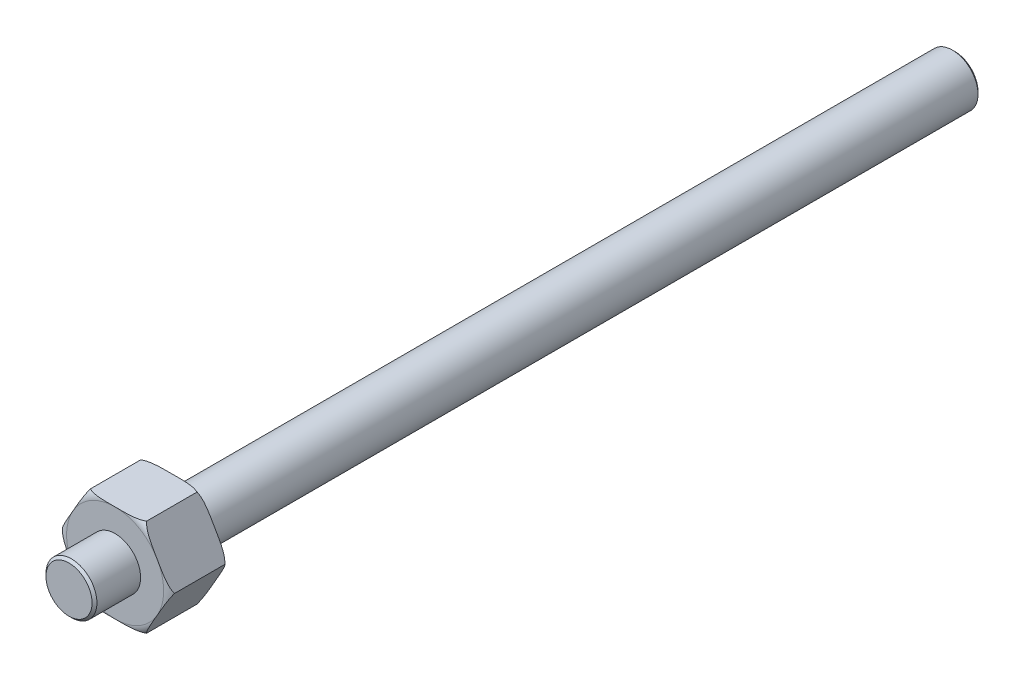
ISO-10303-21;
HEADER;
FILE_DESCRIPTION(('STEP AP214'),'2;1');
FILE_NAME('part.step','',(''),(''),'','','');
FILE_SCHEMA(('AUTOMOTIVE_DESIGN { 1 0 10303 214 1 1 1 1 }'));
ENDSEC;
DATA;
#1=APPLICATION_CONTEXT('core data for automotive mechanical design processes');
#2=APPLICATION_PROTOCOL_DEFINITION('international standard','automotive_design',2000,#1);
#3=PRODUCT_CONTEXT('',#1,'mechanical');
#4=PRODUCT('Part','Part','',(#3));
#5=PRODUCT_RELATED_PRODUCT_CATEGORY('part','',(#4));
#6=PRODUCT_DEFINITION_FORMATION('','',#4);
#7=PRODUCT_DEFINITION_CONTEXT('part definition',#1,'design');
#8=PRODUCT_DEFINITION('design','',#6,#7);
#9=PRODUCT_DEFINITION_SHAPE('','',#8);
#10=(LENGTH_UNIT() NAMED_UNIT(*) SI_UNIT(.MILLI.,.METRE.));
#11=(NAMED_UNIT(*) PLANE_ANGLE_UNIT() SI_UNIT($,.RADIAN.));
#12=(NAMED_UNIT(*) SI_UNIT($,.STERADIAN.) SOLID_ANGLE_UNIT());
#13=UNCERTAINTY_MEASURE_WITH_UNIT(LENGTH_MEASURE(1.E-05),#10,'distance_accuracy_value','');
#14=(GEOMETRIC_REPRESENTATION_CONTEXT(3) GLOBAL_UNCERTAINTY_ASSIGNED_CONTEXT((#13)) GLOBAL_UNIT_ASSIGNED_CONTEXT((#10,
#11,#12)) REPRESENTATION_CONTEXT('',''));
#15=CARTESIAN_POINT('',(0.,0.,0.));
#16=DIRECTION('',(0.,0.,1.));
#17=DIRECTION('',(1.,0.,0.));
#18=AXIS2_PLACEMENT_3D('',#15,#16,#17);
#19=CARTESIAN_POINT('',(-2.3094010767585,-4.,4.7));
#20=DIRECTION('',(-0.866025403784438,-0.500000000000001,0.));
#21=DIRECTION('',(0.500000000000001,-0.866025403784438,0.));
#22=AXIS2_PLACEMENT_3D('',#19,#20,#21);
#23=PLANE('',#22);
#24=DIRECTION('',(0.,0.,-1.));
#25=VECTOR('',#24,1.);
#26=CARTESIAN_POINT('',(-2.3094010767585,-4.,4.7));
#27=LINE('',#26,#25);
#28=CARTESIAN_POINT('',(-2.30940107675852,-4.,4.42481390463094));
#29=VERTEX_POINT('',#28);
#30=CARTESIAN_POINT('',(-2.30940107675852,-4.,0.275186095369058));
#31=VERTEX_POINT('',#30);
#32=EDGE_CURVE('E158',#29,#31,#27,.T.);
#33=ORIENTED_EDGE('',*,*,#32,.F.);
#34=CARTESIAN_POINT('',(-2.3092711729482,-4.00022499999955,4.42466984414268));
#35=CARTESIAN_POINT('',(-2.33045668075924,-3.96353062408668,4.44811889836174));
#36=CARTESIAN_POINT('',(-2.35224948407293,-3.92578438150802,4.46917821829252));
#37=CARTESIAN_POINT('',(-2.3966565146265,-3.84886914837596,4.50715088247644));
#38=CARTESIAN_POINT('',(-2.4192683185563,-3.80970435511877,4.52407546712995));
#39=CARTESIAN_POINT('',(-2.46468554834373,-3.73103940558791,4.55429745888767));
#40=CARTESIAN_POINT('',(-2.48748253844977,-3.69155386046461,4.56764702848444));
#41=CARTESIAN_POINT('',(-2.53344331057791,-3.61194746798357,4.59158874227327));
#42=CARTESIAN_POINT('',(-2.55660727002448,-3.57182631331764,4.60217950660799));
#43=CARTESIAN_POINT('',(-2.62320358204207,-3.45647811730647,4.62918671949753));
#44=CARTESIAN_POINT('',(-2.66692087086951,-3.38075755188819,4.6427715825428));
#45=CARTESIAN_POINT('',(-2.75470919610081,-3.22870371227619,4.66434205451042));
#46=CARTESIAN_POINT('',(-2.79878052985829,-3.1523699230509,4.67232231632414));
#47=CARTESIAN_POINT('',(-2.88717650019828,-2.99926361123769,4.68449892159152));
#48=CARTESIAN_POINT('',(-2.93150150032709,-2.9224904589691,4.68868395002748));
#49=CARTESIAN_POINT('',(-3.02016982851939,-2.76891240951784,4.69467200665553));
#50=CARTESIAN_POINT('',(-3.06451314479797,-2.69210753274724,4.69647586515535));
#51=CARTESIAN_POINT('',(-3.15410266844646,-2.53693392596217,4.69883732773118));
#52=CARTESIAN_POINT('',(-3.19934900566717,-2.4585649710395,4.69936899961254));
#53=CARTESIAN_POINT('',(-3.28984454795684,-2.3018220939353,4.69993855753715));
#54=CARTESIAN_POINT('',(-3.33509375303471,-2.22344817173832,4.6999764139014));
#55=CARTESIAN_POINT('',(-3.42551464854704,-2.06683458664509,4.70000880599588));
#56=CARTESIAN_POINT('',(-3.47068633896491,-1.98859492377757,4.70000341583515));
#57=CARTESIAN_POINT('',(-3.56102887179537,-1.83211706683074,4.69999443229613));
#58=CARTESIAN_POINT('',(-3.60619971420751,-1.75387887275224,4.69999083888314));
#59=CARTESIAN_POINT('',(-3.70717556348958,-1.57898357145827,4.69960067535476));
#60=CARTESIAN_POINT('',(-3.76298052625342,-1.48232654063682,4.69912414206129));
#61=CARTESIAN_POINT('',(-3.87462340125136,-1.28895540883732,4.69619390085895));
#62=CARTESIAN_POINT('',(-3.93046130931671,-1.19224131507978,4.69373881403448));
#63=CARTESIAN_POINT('',(-4.04117476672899,-1.00047998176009,4.68462038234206));
#64=CARTESIAN_POINT('',(-4.09605152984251,-0.905430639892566,4.67802441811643));
#65=CARTESIAN_POINT('',(-4.20549171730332,-0.715874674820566,4.65770160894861));
#66=CARTESIAN_POINT('',(-4.26005533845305,-0.621367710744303,4.64397989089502));
#67=CARTESIAN_POINT('',(-4.3402756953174,-0.482421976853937,4.61529637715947));
#68=CARTESIAN_POINT('',(-4.36631130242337,-0.437326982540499,4.60463311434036));
#69=CARTESIAN_POINT('',(-4.41797751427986,-0.347838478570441,4.58008239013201));
#70=CARTESIAN_POINT('',(-4.44360851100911,-0.303444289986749,4.56619828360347));
#71=CARTESIAN_POINT('',(-4.49480197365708,-0.214774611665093,4.53416401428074));
#72=CARTESIAN_POINT('',(-4.52035187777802,-0.170520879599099,4.51593097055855));
#73=CARTESIAN_POINT('',(-4.55794686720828,-0.105404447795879,4.48479998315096));
#74=CARTESIAN_POINT('',(-4.57037931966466,-0.0838708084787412,4.47376869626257));
#75=CARTESIAN_POINT('',(-4.5949199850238,-0.041365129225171,4.45030413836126));
#76=CARTESIAN_POINT('',(-4.60702793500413,-0.0203935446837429,4.43786977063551));
#77=CARTESIAN_POINT('',(-4.61893205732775,0.000225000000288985,4.42466984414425));
#78=B_SPLINE_CURVE_WITH_KNOTS('',3,(#34,#35,#36,#37,#38,#39,#40,#41,#42,#43,#44,#45,#46,#47,#48,
#49,#50,#51,#52,#53,#54,#55,#56,#57,#58,#59,#60,#61,#62,#63,#64,#65,#66,#67,#68,#69,#70,#71,#72,
#73,#74,#75,#76,#77),.UNSPECIFIED.,.F.,.F.,(4,2,2,2,2,2,2,2,2,2,2,2,2,2,2,2,2,2,2,2,2,4),(0.,
0.145070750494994,0.289742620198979,0.432171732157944,0.574671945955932,0.839822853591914,
1.1052263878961,1.37141861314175,1.63751799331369,1.90899698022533,2.18049228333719,
2.45152244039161,2.72254736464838,3.05737836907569,3.39244292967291,3.7221917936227,
4.05170373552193,4.21107708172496,4.3702851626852,4.5328114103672,4.61437844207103,
4.6960096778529),.UNSPECIFIED.);
#79=CARTESIAN_POINT('',(-3.46410161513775,-2.,4.7));
#80=VERTEX_POINT('',#79);
#81=EDGE_CURVE('E135',#29,#80,#78,.T.);
#82=ORIENTED_EDGE('',*,*,#81,.T.);
#83=CARTESIAN_POINT('',(-4.61880215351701,0.,4.42481390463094));
#84=VERTEX_POINT('',#83);
#85=EDGE_CURVE('E120',#80,#84,#78,.T.);
#86=ORIENTED_EDGE('',*,*,#85,.T.);
#87=DIRECTION('',(0.,0.,-1.));
#88=VECTOR('',#87,1.);
#89=CARTESIAN_POINT('',(-4.61880215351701,0.,4.7));
#90=LINE('',#89,#88);
#91=CARTESIAN_POINT('',(-4.61880215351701,0.,0.275186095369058));
#92=VERTEX_POINT('',#91);
#93=EDGE_CURVE('E133',#84,#92,#90,.T.);
#94=ORIENTED_EDGE('',*,*,#93,.T.);
#95=CARTESIAN_POINT('',(-4.61891762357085,0.00019999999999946,0.275314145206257));
#96=CARTESIAN_POINT('',(-4.59773083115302,-0.0364966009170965,0.251865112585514));
#97=CARTESIAN_POINT('',(-4.57593675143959,-0.0742450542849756,0.230805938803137));
#98=CARTESIAN_POINT('',(-4.53152719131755,-0.151164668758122,0.192833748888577));
#99=CARTESIAN_POINT('',(-4.50891413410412,-0.190331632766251,0.175909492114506));
#100=CARTESIAN_POINT('',(-4.46349438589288,-0.269000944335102,0.145688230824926));
#101=CARTESIAN_POINT('',(-4.44069612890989,-0.308488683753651,0.132339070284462));
#102=CARTESIAN_POINT('',(-4.3947328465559,-0.388099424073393,0.108398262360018));
#103=CARTESIAN_POINT('',(-4.37156764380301,-0.428222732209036,0.0978079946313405));
#104=CARTESIAN_POINT('',(-4.30496354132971,-0.543584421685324,0.0708005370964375));
#105=CARTESIAN_POINT('',(-4.26123965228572,-0.619316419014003,0.0572157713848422));
#106=CARTESIAN_POINT('',(-4.17343813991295,-0.771393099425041,0.0356463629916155));
#107=CARTESIAN_POINT('',(-4.12936021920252,-0.847738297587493,0.0276670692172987));
#108=CARTESIAN_POINT('',(-4.04095107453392,-1.00086742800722,0.0154926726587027));
#109=CARTESIAN_POINT('',(-3.99661948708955,-1.07765198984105,0.0113088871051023));
#110=CARTESIAN_POINT('',(-3.90793801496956,-1.23125280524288,0.00532316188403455));
#111=CARTESIAN_POINT('',(-3.86358814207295,-1.30806903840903,0.00352039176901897));
#112=CARTESIAN_POINT('',(-3.77398539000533,-1.46326555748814,0.00116071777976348));
#113=CARTESIAN_POINT('',(-3.7287323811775,-1.5416460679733,0.00062973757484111));
#114=CARTESIAN_POINT('',(-3.63822349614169,-1.69841205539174,6.10895565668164E-05));
#115=CARTESIAN_POINT('',(-3.59296761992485,-1.77679753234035,2.34513994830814E-05));
#116=CARTESIAN_POINT('',(-3.50253339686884,-1.93343420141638,-8.77575471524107E-06));
#117=CARTESIAN_POINT('',(-3.45735505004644,-2.01168539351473,-3.43839963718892E-06));
#118=CARTESIAN_POINT('',(-3.36699920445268,-2.16818630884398,5.61842359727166E-06));
#119=CARTESIAN_POINT('',(-3.32182170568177,-2.24643603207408,9.3379229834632E-06));
#120=CARTESIAN_POINT('',(-3.22084751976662,-2.42132845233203,0.000400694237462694));
#121=CARTESIAN_POINT('',(-3.1650508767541,-2.51797107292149,0.000878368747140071));
#122=CARTESIAN_POINT('',(-3.05342466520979,-2.71131334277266,0.00381217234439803));
#123=CARTESIAN_POINT('',(-2.99759510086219,-2.80801298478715,0.00626968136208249));
#124=CARTESIAN_POINT('',(-2.88689825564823,-2.99974554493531,0.0153938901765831));
#125=CARTESIAN_POINT('',(-2.83202975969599,-3.09478056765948,0.0219931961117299));
#126=CARTESIAN_POINT('',(-2.72260630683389,-3.28430754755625,0.0423229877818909));
#127=CARTESIAN_POINT('',(-2.66805115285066,-3.37879984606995,0.0560483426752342));
#128=CARTESIAN_POINT('',(-2.58784820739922,-3.51771542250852,0.0847350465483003));
#129=CARTESIAN_POINT('',(-2.56182139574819,-3.56279518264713,0.0953976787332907));
#130=CARTESIAN_POINT('',(-2.51017264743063,-3.65225343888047,0.119945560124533));
#131=CARTESIAN_POINT('',(-2.48455031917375,-3.69663261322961,0.133827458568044));
#132=CARTESIAN_POINT('',(-2.43337424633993,-3.78527217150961,0.16585497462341));
#133=CARTESIAN_POINT('',(-2.40783305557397,-3.82951081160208,0.184083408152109));
#134=CARTESIAN_POINT('',(-2.37025072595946,-3.89460531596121,0.215205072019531));
#135=CARTESIAN_POINT('',(-2.35782244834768,-3.91613172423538,0.226232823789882));
#136=CARTESIAN_POINT('',(-2.33328991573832,-3.95862331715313,0.249689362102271));
#137=CARTESIAN_POINT('',(-2.32118592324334,-3.97958804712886,0.262119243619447));
#138=CARTESIAN_POINT('',(-2.30928560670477,-4.00019999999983,0.275314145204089));
#139=B_SPLINE_CURVE_WITH_KNOTS('',3,(#95,#96,#97,#98,#99,#100,#101,#102,#103,#104,#105,#106,
#107,#108,#109,#110,#111,#112,#113,#114,#115,#116,#117,#118,#119,#120,#121,#122,#123,#124,#125,
#126,#127,#128,#129,#130,#131,#132,#133,#134,#135,#136,#137,#138),.UNSPECIFIED.,.F.,.F.,(4,2,2,
2,2,2,2,2,2,2,2,2,2,2,2,2,2,2,2,2,2,4),(0.,0.145077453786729,0.289756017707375,0.43219207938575,
0.574699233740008,0.839889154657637,1.10533178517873,1.37156332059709,1.63770197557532,
1.90922098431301,2.18075631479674,2.45182641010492,2.72289127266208,3.05767236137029,
3.39268699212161,3.72238688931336,4.05184972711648,4.21117104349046,4.37032726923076,
4.53279983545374,4.6143397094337,4.69594370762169),.UNSPECIFIED.);
#140=CARTESIAN_POINT('',(-3.46410161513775,-2.,0.));
#141=VERTEX_POINT('',#140);
#142=EDGE_CURVE('E309',#92,#141,#139,.T.);
#143=ORIENTED_EDGE('',*,*,#142,.T.);
#144=EDGE_CURVE('E149',#141,#31,#139,.T.);
#145=ORIENTED_EDGE('',*,*,#144,.T.);
#146=EDGE_LOOP('',(#33,#82,#86,#94,#143,#145));
#147=FACE_BOUND('',#146,.T.);
#148=ADVANCED_FACE('F27',(#147),#23,.T.);
#149=CARTESIAN_POINT('',(2.3094010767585,-4.,4.7));
#150=DIRECTION('',(0.,-1.,0.));
#151=DIRECTION('',(0.,0.,-1.));
#152=AXIS2_PLACEMENT_3D('',#149,#150,#151);
#153=PLANE('',#152);
#154=CARTESIAN_POINT('',(0.,-4.,4.7));
#155=CARTESIAN_POINT('',(-0.0696781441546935,-4.,4.69999994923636));
#156=CARTESIAN_POINT('',(-0.139356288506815,-4.,4.70000596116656));
#157=CARTESIAN_POINT('',(-0.278713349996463,-4.,4.69995828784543));
#158=CARTESIAN_POINT('',(-0.348392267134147,-4.,4.69990460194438));
#159=CARTESIAN_POINT('',(-0.487828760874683,-4.,4.6995253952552));
#160=CARTESIAN_POINT('',(-0.557586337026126,-4.,4.69919956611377));
#161=CARTESIAN_POINT('',(-0.697095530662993,-4.,4.6979290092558));
#162=CARTESIAN_POINT('',(-0.766847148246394,-4.,4.69698429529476));
#163=CARTESIAN_POINT('',(-0.906081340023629,-4.,4.69400783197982));
#164=CARTESIAN_POINT('',(-0.975563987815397,-4.,4.69197996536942));
#165=CARTESIAN_POINT('',(-1.11445749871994,-4.,4.68624921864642));
#166=CARTESIAN_POINT('',(-1.18386836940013,-4.,4.68254653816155));
#167=CARTESIAN_POINT('',(-1.32242215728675,-4.,4.67275405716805));
#168=CARTESIAN_POINT('',(-1.39156532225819,-4.,4.66666792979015));
#169=CARTESIAN_POINT('',(-1.52948040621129,-4.,4.65124744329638));
#170=CARTESIAN_POINT('',(-1.59825246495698,-4.,4.64191440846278));
#171=CARTESIAN_POINT('',(-1.71392846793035,-4.,4.6224951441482));
#172=CARTESIAN_POINT('',(-1.76101948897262,-4.,4.61353396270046));
#173=CARTESIAN_POINT('',(-1.85469214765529,-4.,4.59313310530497));
#174=CARTESIAN_POINT('',(-1.90127356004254,-4.,4.58169237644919));
#175=CARTESIAN_POINT('',(-1.99351080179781,-4.,4.55587891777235));
#176=CARTESIAN_POINT('',(-2.03916856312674,-4.,4.54151320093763));
#177=CARTESIAN_POINT('',(-2.12921043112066,-4.,4.50927328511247));
#178=CARTESIAN_POINT('',(-2.17359547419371,-4.,4.49140174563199));
#179=CARTESIAN_POINT('',(-2.26203348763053,-4.,4.45076067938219));
#180=CARTESIAN_POINT('',(-2.30601759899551,-4.,4.42783862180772));
#181=CARTESIAN_POINT('',(-2.39083412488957,-4.,4.37664696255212));
#182=CARTESIAN_POINT('',(-2.43166737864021,-4.,4.34837879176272));
#183=CARTESIAN_POINT('',(-2.50072079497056,-4.,4.29189176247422));
#184=CARTESIAN_POINT('',(-2.52983522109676,-4.,4.26477853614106));
#185=CARTESIAN_POINT('',(-2.58343302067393,-4.,4.20628808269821));
#186=CARTESIAN_POINT('',(-2.60792517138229,-4.,4.17491913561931));
#187=CARTESIAN_POINT('',(-2.64501761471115,-4.,4.11659618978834));
#188=CARTESIAN_POINT('',(-2.65905737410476,-4.,4.09056285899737));
#189=CARTESIAN_POINT('',(-2.68270586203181,-4.,4.0365416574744));
#190=CARTESIAN_POINT('',(-2.69231793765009,-4.,4.0085552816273));
#191=CARTESIAN_POINT('',(-2.70640829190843,-4.,3.9510887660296));
#192=CARTESIAN_POINT('',(-2.71085050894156,-4.,3.92159961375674));
#193=CARTESIAN_POINT('',(-2.71405528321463,-4.,3.86231442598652));
#194=CARTESIAN_POINT('',(-2.71281970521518,-4.,3.83251849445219));
#195=CARTESIAN_POINT('',(-2.70521918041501,-4.,3.77676756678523));
#196=CARTESIAN_POINT('',(-2.69940081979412,-4.,3.75073528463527));
#197=CARTESIAN_POINT('',(-2.68373932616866,-4.,3.69992363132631));
#198=CARTESIAN_POINT('',(-2.67389499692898,-4.,3.67514463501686));
#199=CARTESIAN_POINT('',(-2.64689474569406,-4.,3.61925536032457));
#200=CARTESIAN_POINT('',(-2.62839486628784,-4.,3.58879578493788));
#201=CARTESIAN_POINT('',(-2.58671843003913,-4.,3.53126403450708));
#202=CARTESIAN_POINT('',(-2.56353184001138,-4.,3.50419933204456));
#203=CARTESIAN_POINT('',(-2.50163474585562,-4.,3.44111993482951));
#204=CARTESIAN_POINT('',(-2.46085631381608,-4.,3.40714840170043));
#205=CARTESIAN_POINT('',(-2.37466387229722,-4.,3.3458357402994));
#206=CARTESIAN_POINT('',(-2.32924264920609,-4.,3.31850515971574));
#207=CARTESIAN_POINT('',(-2.24044999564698,-4.,3.27199575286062));
#208=CARTESIAN_POINT('',(-2.19736255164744,-4.,3.25226281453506));
#209=CARTESIAN_POINT('',(-2.10963501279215,-4.,3.21655503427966));
#210=CARTESIAN_POINT('',(-2.06499352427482,-4.,3.20058367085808));
#211=CARTESIAN_POINT('',(-1.97457651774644,-4.,3.17177186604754));
#212=CARTESIAN_POINT('',(-1.92879794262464,-4.,3.1589411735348));
#213=CARTESIAN_POINT('',(-1.83661733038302,-4.,3.1359685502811));
#214=CARTESIAN_POINT('',(-1.79021576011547,-4.,3.12582471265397));
#215=CARTESIAN_POINT('',(-1.64942657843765,-4.,3.0985451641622));
#216=CARTESIAN_POINT('',(-1.55437940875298,-4.,3.08483432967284));
#217=CARTESIAN_POINT('',(-1.36357658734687,-4.,3.06357202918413));
#218=CARTESIAN_POINT('',(-1.2678202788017,-4.,3.05602726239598));
#219=CARTESIAN_POINT('',(-1.07574306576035,-4.,3.04490140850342));
#220=CARTESIAN_POINT('',(-0.979421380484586,-4.,3.04133501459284));
#221=CARTESIAN_POINT('',(-0.786773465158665,-4.,3.03650280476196));
#222=CARTESIAN_POINT('',(-0.690447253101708,-4.,3.03523604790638));
#223=CARTESIAN_POINT('',(-0.497265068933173,-4.,3.03373884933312));
#224=CARTESIAN_POINT('',(-0.400409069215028,-4.,3.03351409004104));
#225=CARTESIAN_POINT('',(-0.20669028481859,-4.,3.03331131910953));
#226=CARTESIAN_POINT('',(-0.109827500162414,-4.,3.0333333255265));
#227=CARTESIAN_POINT('',(0.0837170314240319,-4.,3.0333333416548));
#228=CARTESIAN_POINT('',(0.180398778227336,-4.,3.03331143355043));
#229=CARTESIAN_POINT('',(0.373760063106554,-4.,3.03346548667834));
#230=CARTESIAN_POINT('',(0.470439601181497,-4.,3.03364144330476));
#231=CARTESIAN_POINT('',(0.662676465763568,-4.,3.03493904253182));
#232=CARTESIAN_POINT('',(0.758233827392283,-4.,3.03604971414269));
#233=CARTESIAN_POINT('',(0.949373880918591,-4.,3.04038887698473));
#234=CARTESIAN_POINT('',(1.0449565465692,-4.,3.04361879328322));
#235=CARTESIAN_POINT('',(1.23568635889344,-4.,3.05380911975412));
#236=CARTESIAN_POINT('',(1.33083397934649,-4.,3.06075920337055));
#237=CARTESIAN_POINT('',(1.52046963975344,-4.,3.08047061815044));
#238=CARTESIAN_POINT('',(1.61495820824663,-4.,3.09322656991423));
#239=CARTESIAN_POINT('',(1.80353756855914,-4.,3.12746308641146));
#240=CARTESIAN_POINT('',(1.89761355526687,-4.,3.14903459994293));
#241=CARTESIAN_POINT('',(2.03581818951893,-4.,3.19077537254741));
#242=CARTESIAN_POINT('',(2.08136111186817,-4.,3.20623443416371));
#243=CARTESIAN_POINT('',(2.17098259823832,-4.,3.2408971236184));
#244=CARTESIAN_POINT('',(2.21506243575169,-4.,3.26009738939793));
#245=CARTESIAN_POINT('',(2.29900972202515,-4.,3.30194337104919));
#246=CARTESIAN_POINT('',(2.33897778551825,-4.,3.32438435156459));
#247=CARTESIAN_POINT('',(2.41591858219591,-4.,3.37400809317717));
#248=CARTESIAN_POINT('',(2.45289197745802,-4.,3.40118980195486));
#249=CARTESIAN_POINT('',(2.51712765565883,-4.,3.45651429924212));
#250=CARTESIAN_POINT('',(2.54501732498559,-4.,3.48391951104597));
#251=CARTESIAN_POINT('',(2.59604108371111,-4.,3.54286955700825));
#252=CARTESIAN_POINT('',(2.61918390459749,-4.,3.57440661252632));
#253=CARTESIAN_POINT('',(2.65383835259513,-4.,3.63282603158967));
#254=CARTESIAN_POINT('',(2.66681095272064,-4.,3.65883730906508));
#255=CARTESIAN_POINT('',(2.6883197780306,-4.,3.7126442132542));
#256=CARTESIAN_POINT('',(2.69685955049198,-4.,3.74043839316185));
#257=CARTESIAN_POINT('',(2.70886984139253,-4.,3.79729789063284));
#258=CARTESIAN_POINT('',(2.71230919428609,-4.,3.82636991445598));
#259=CARTESIAN_POINT('',(2.71369811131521,-4.,3.88464481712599));
#260=CARTESIAN_POINT('',(2.71164863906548,-4.,3.91384767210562));
#261=CARTESIAN_POINT('',(2.70268435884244,-4.,3.96877408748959));
#262=CARTESIAN_POINT('',(2.69622425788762,-4.,3.99457416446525));
#263=CARTESIAN_POINT('',(2.67938527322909,-4.,4.04484941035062));
#264=CARTESIAN_POINT('',(2.6690050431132,-4.,4.06932412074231));
#265=CARTESIAN_POINT('',(2.64050061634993,-4.,4.12522123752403));
#266=CARTESIAN_POINT('',(2.62093259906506,-4.,4.15590621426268));
#267=CARTESIAN_POINT('',(2.57711408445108,-4.,4.21372251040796));
#268=CARTESIAN_POINT('',(2.55285371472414,-4.,4.24084613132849));
#269=CARTESIAN_POINT('',(2.48790323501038,-4.,4.30433985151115));
#270=CARTESIAN_POINT('',(2.44508052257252,-4.,4.33851320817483));
#271=CARTESIAN_POINT('',(2.35479794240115,-4.,4.39996318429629));
#272=CARTESIAN_POINT('',(2.30732886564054,-4.,4.42722570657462));
#273=CARTESIAN_POINT('',(2.21404581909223,-4.,4.47375829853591));
#274=CARTESIAN_POINT('',(2.16847718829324,-4.,4.49353115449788));
#275=CARTESIAN_POINT('',(2.07579618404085,-4.,4.52911383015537));
#276=CARTESIAN_POINT('',(2.02868243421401,-4.,4.54492000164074));
#277=CARTESIAN_POINT('',(1.93338570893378,-4.,4.57324458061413));
#278=CARTESIAN_POINT('',(1.8852006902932,-4.,4.5857559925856));
#279=CARTESIAN_POINT('',(1.78823179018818,-4.,4.60800551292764));
#280=CARTESIAN_POINT('',(1.7394482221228,-4.,4.61774501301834));
#281=CARTESIAN_POINT('',(1.62116079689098,-4.,4.63850985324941));
#282=CARTESIAN_POINT('',(1.55145845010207,-4.,4.64839188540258));
#283=CARTESIAN_POINT('',(1.4116431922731,-4.,4.66471726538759));
#284=CARTESIAN_POINT('',(1.34153011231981,-4.,4.67115908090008));
#285=CARTESIAN_POINT('',(1.20100870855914,-4.,4.68152425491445));
#286=CARTESIAN_POINT('',(1.13060008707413,-4.,4.68544338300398));
#287=CARTESIAN_POINT('',(0.989703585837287,-4.,4.69150931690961));
#288=CARTESIAN_POINT('',(0.919215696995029,-4.,4.6936558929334));
#289=CARTESIAN_POINT('',(0.777963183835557,-4.,4.69680683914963));
#290=CARTESIAN_POINT('',(0.707198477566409,-4.,4.69780706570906));
#291=CARTESIAN_POINT('',(0.565662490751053,-4.,4.69915235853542));
#292=CARTESIAN_POINT('',(0.49489121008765,-4.,4.69949740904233));
#293=CARTESIAN_POINT('',(0.353433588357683,-4.,4.69989895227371));
#294=CARTESIAN_POINT('',(0.28274724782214,-4.,4.69995579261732));
#295=CARTESIAN_POINT('',(0.141373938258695,-4.,4.70000634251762));
#296=CARTESIAN_POINT('',(0.0706869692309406,-4.,4.70000005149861));
#297=CARTESIAN_POINT('',(0.,-4.,4.7));
#298=B_SPLINE_CURVE_WITH_KNOTS('',3,(#154,#155,#156,#157,#158,#159,#160,#161,#162,#163,#164,
#165,#166,#167,#168,#169,#170,#171,#172,#173,#174,#175,#176,#177,#178,#179,#180,#181,#182,#183,
#184,#185,#186,#187,#188,#189,#190,#191,#192,#193,#194,#195,#196,#197,#198,#199,#200,#201,#202,
#203,#204,#205,#206,#207,#208,#209,#210,#211,#212,#213,#214,#215,#216,#217,#218,#219,#220,#221,
#222,#223,#224,#225,#226,#227,#228,#229,#230,#231,#232,#233,#234,#235,#236,#237,#238,#239,#240,
#241,#242,#243,#244,#245,#246,#247,#248,#249,#250,#251,#252,#253,#254,#255,#256,#257,#258,#259,
#260,#261,#262,#263,#264,#265,#266,#267,#268,#269,#270,#271,#272,#273,#274,#275,#276,#277,#278,
#279,#280,#281,#282,#283,#284,#285,#286,#287,#288,#289,#290,#291,#292,#293,#294,#295,#296,#297),
.UNSPECIFIED.,.T.,.F.,(4,2,2,2,2,2,2,2,2,2,2,2,2,2,2,2,2,2,2,2,2,2,2,2,2,2,2,2,2,2,2,2,2,2,2,2,
2,2,2,2,2,2,2,2,2,2,2,2,2,2,2,2,2,2,2,2,2,2,2,2,2,2,2,2,2,2,2,2,2,2,2,4),(0.,0.209034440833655,
0.418071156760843,0.627345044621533,0.836614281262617,1.04513834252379,1.25363755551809,
1.46181670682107,1.66991104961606,1.8136664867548,1.95748308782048,2.10095884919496,
2.24432618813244,2.39282955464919,2.54129323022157,2.6602657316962,2.77900999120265,
2.86740574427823,2.95573456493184,3.04467588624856,3.13358799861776,3.21325708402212,
3.29294985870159,3.39926863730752,3.5058174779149,3.66415079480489,3.82273396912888,
3.96469886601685,4.10679453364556,4.24932583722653,4.39175571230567,4.67949460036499,
4.96754569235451,5.25665714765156,5.54565028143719,5.83621756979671,6.12680611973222,
6.41685135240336,6.70688983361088,6.99357078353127,7.28044470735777,7.56652641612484,
7.85234359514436,8.14118709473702,8.28534493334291,8.42937381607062,8.56662276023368,
8.70384127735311,8.82075223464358,8.93744617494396,9.02430839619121,9.11110100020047,
9.19842178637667,9.28572724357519,9.36517143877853,9.44464294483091,9.55321371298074,
9.66201544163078,9.82545507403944,9.98922546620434,10.1380258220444,10.2869625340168,
10.4362129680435,10.5853883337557,10.7964615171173,11.0076286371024,11.2191489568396,
11.4306966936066,11.6430067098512,11.8553218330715,12.0673808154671,12.2794417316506),.UNSPECIFIED.);
#299=CARTESIAN_POINT('',(2.3094010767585,-4.00000000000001,4.42481390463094));
#300=VERTEX_POINT('',#299);
#301=CARTESIAN_POINT('',(0.,-4.,4.7));
#302=VERTEX_POINT('',#301);
#303=EDGE_CURVE('E247',#300,#302,#298,.T.);
#304=ORIENTED_EDGE('',*,*,#303,.T.);
#305=EDGE_CURVE('E238',#302,#29,#298,.T.);
#306=ORIENTED_EDGE('',*,*,#305,.T.);
#307=ORIENTED_EDGE('',*,*,#32,.T.);
#308=CARTESIAN_POINT('',(0.,-4.,0.));
#309=CARTESIAN_POINT('',(0.0696781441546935,-4.,5.0763636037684E-08));
#310=CARTESIAN_POINT('',(0.139356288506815,-4.,-5.96116655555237E-06));
#311=CARTESIAN_POINT('',(0.278713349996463,-4.,4.17121545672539E-05));
#312=CARTESIAN_POINT('',(0.348392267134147,-4.,9.53980556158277E-05));
#313=CARTESIAN_POINT('',(0.487828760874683,-4.,0.000474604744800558));
#314=CARTESIAN_POINT('',(0.557586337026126,-4.,0.000800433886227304));
#315=CARTESIAN_POINT('',(0.697095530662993,-4.,0.00207099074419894));
#316=CARTESIAN_POINT('',(0.766847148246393,-4.,0.00301570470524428));
#317=CARTESIAN_POINT('',(0.906081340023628,-4.,0.00599216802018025));
#318=CARTESIAN_POINT('',(0.975563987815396,-4.,0.00802003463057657));
#319=CARTESIAN_POINT('',(1.11445749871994,-4.,0.013750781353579));
#320=CARTESIAN_POINT('',(1.18386836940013,-4.,0.0174534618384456));
#321=CARTESIAN_POINT('',(1.32242215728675,-4.,0.0272459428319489));
#322=CARTESIAN_POINT('',(1.39156532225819,-4.,0.0333320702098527));
#323=CARTESIAN_POINT('',(1.52948040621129,-4.,0.0487525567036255));
#324=CARTESIAN_POINT('',(1.59825246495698,-4.,0.0580855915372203));
#325=CARTESIAN_POINT('',(1.71392846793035,-4.,0.0775048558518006));
#326=CARTESIAN_POINT('',(1.76101948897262,-4.,0.0864660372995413));
#327=CARTESIAN_POINT('',(1.85469214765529,-4.,0.106866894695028));
#328=CARTESIAN_POINT('',(1.90127356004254,-4.,0.118307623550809));
#329=CARTESIAN_POINT('',(1.99351080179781,-4.,0.144121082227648));
#330=CARTESIAN_POINT('',(2.03916856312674,-4.,0.158486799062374));
#331=CARTESIAN_POINT('',(2.12921043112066,-4.,0.190726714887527));
#332=CARTESIAN_POINT('',(2.17359547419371,-4.,0.208598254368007));
#333=CARTESIAN_POINT('',(2.26203348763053,-4.,0.249239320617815));
#334=CARTESIAN_POINT('',(2.30601759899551,-4.,0.272161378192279));
#335=CARTESIAN_POINT('',(2.39083412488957,-4.,0.323353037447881));
#336=CARTESIAN_POINT('',(2.43166737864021,-4.,0.351621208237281));
#337=CARTESIAN_POINT('',(2.50072079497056,-4.,0.40810823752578));
#338=CARTESIAN_POINT('',(2.52983522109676,-4.,0.435221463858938));
#339=CARTESIAN_POINT('',(2.58343302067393,-4.,0.493711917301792));
#340=CARTESIAN_POINT('',(2.60792517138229,-4.,0.525080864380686));
#341=CARTESIAN_POINT('',(2.64501761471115,-4.,0.583403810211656));
#342=CARTESIAN_POINT('',(2.65905737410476,-4.,0.609437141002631));
#343=CARTESIAN_POINT('',(2.68270586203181,-4.,0.663458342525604));
#344=CARTESIAN_POINT('',(2.69231793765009,-4.,0.691444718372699));
#345=CARTESIAN_POINT('',(2.70640829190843,-4.,0.748911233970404));
#346=CARTESIAN_POINT('',(2.71085050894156,-4.,0.778400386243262));
#347=CARTESIAN_POINT('',(2.71405528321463,-4.,0.837685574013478));
#348=CARTESIAN_POINT('',(2.71281970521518,-4.,0.867481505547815));
#349=CARTESIAN_POINT('',(2.70521918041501,-4.,0.92323243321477));
#350=CARTESIAN_POINT('',(2.69940081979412,-4.,0.94926471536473));
#351=CARTESIAN_POINT('',(2.68373932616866,-4.,1.0000763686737));
#352=CARTESIAN_POINT('',(2.67389499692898,-4.,1.02485536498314));
#353=CARTESIAN_POINT('',(2.64689474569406,-4.,1.08074463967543));
#354=CARTESIAN_POINT('',(2.62839486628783,-4.,1.11120421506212));
#355=CARTESIAN_POINT('',(2.58671843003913,-4.,1.16873596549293));
#356=CARTESIAN_POINT('',(2.56353184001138,-4.,1.19580066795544));
#357=CARTESIAN_POINT('',(2.50163474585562,-4.,1.25888006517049));
#358=CARTESIAN_POINT('',(2.46085631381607,-4.,1.29285159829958));
#359=CARTESIAN_POINT('',(2.37466387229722,-4.,1.3541642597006));
#360=CARTESIAN_POINT('',(2.32924264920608,-4.,1.38149484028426));
#361=CARTESIAN_POINT('',(2.24044999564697,-4.,1.42800424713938));
#362=CARTESIAN_POINT('',(2.19736255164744,-4.,1.44773718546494));
#363=CARTESIAN_POINT('',(2.10963501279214,-4.,1.48344496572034));
#364=CARTESIAN_POINT('',(2.06499352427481,-4.,1.49941632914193));
#365=CARTESIAN_POINT('',(1.97457651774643,-4.,1.52822813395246));
#366=CARTESIAN_POINT('',(1.92879794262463,-4.,1.54105882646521));
#367=CARTESIAN_POINT('',(1.83661733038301,-4.,1.5640314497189));
#368=CARTESIAN_POINT('',(1.79021576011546,-4.,1.57417528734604));
#369=CARTESIAN_POINT('',(1.64942657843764,-4.,1.6014548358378));
#370=CARTESIAN_POINT('',(1.55437940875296,-4.,1.61516567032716));
#371=CARTESIAN_POINT('',(1.36357658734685,-4.,1.63642797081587));
#372=CARTESIAN_POINT('',(1.26782027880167,-4.,1.64397273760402));
#373=CARTESIAN_POINT('',(1.07574306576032,-4.,1.65509859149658));
#374=CARTESIAN_POINT('',(0.979421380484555,-4.,1.65866498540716));
#375=CARTESIAN_POINT('',(0.786773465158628,-4.,1.66349719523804));
#376=CARTESIAN_POINT('',(0.690447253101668,-4.,1.66476395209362));
#377=CARTESIAN_POINT('',(0.497265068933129,-4.,1.66626115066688));
#378=CARTESIAN_POINT('',(0.400409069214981,-4.,1.66648590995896));
#379=CARTESIAN_POINT('',(0.206690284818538,-4.,1.66668868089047));
#380=CARTESIAN_POINT('',(0.10982750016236,-4.,1.6666666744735));
#381=CARTESIAN_POINT('',(-0.0837170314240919,-4.,1.6666666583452));
#382=CARTESIAN_POINT('',(-0.180398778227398,-4.,1.66668856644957));
#383=CARTESIAN_POINT('',(-0.373760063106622,-4.,1.66653451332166));
#384=CARTESIAN_POINT('',(-0.470439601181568,-4.,1.66635855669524));
#385=CARTESIAN_POINT('',(-0.662676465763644,-4.,1.66506095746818));
#386=CARTESIAN_POINT('',(-0.758233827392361,-4.,1.66395028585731));
#387=CARTESIAN_POINT('',(-0.949373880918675,-4.,1.65961112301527));
#388=CARTESIAN_POINT('',(-1.04495654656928,-4.,1.65638120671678));
#389=CARTESIAN_POINT('',(-1.23568635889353,-4.,1.64619088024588));
#390=CARTESIAN_POINT('',(-1.33083397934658,-4.,1.63924079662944));
#391=CARTESIAN_POINT('',(-1.52046963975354,-4.,1.61952938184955));
#392=CARTESIAN_POINT('',(-1.61495820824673,-4.,1.60677343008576));
#393=CARTESIAN_POINT('',(-1.80353756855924,-4.,1.57253691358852));
#394=CARTESIAN_POINT('',(-1.89761355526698,-4.,1.55096540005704));
#395=CARTESIAN_POINT('',(-2.03581818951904,-4.,1.50922462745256));
#396=CARTESIAN_POINT('',(-2.08136111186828,-4.,1.49376556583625));
#397=CARTESIAN_POINT('',(-2.17098259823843,-4.,1.45910287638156));
#398=CARTESIAN_POINT('',(-2.2150624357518,-4.,1.43990261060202));
#399=CARTESIAN_POINT('',(-2.29900972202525,-4.,1.39805662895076));
#400=CARTESIAN_POINT('',(-2.33897778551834,-4.,1.37561564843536));
#401=CARTESIAN_POINT('',(-2.41591858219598,-4.,1.32599190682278));
#402=CARTESIAN_POINT('',(-2.45289197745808,-4.,1.29881019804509));
#403=CARTESIAN_POINT('',(-2.51712765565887,-4.,1.24348570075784));
#404=CARTESIAN_POINT('',(-2.54501732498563,-4.,1.21608048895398));
#405=CARTESIAN_POINT('',(-2.59604108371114,-4.,1.1571304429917));
#406=CARTESIAN_POINT('',(-2.61918390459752,-4.,1.12559338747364));
#407=CARTESIAN_POINT('',(-2.65383835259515,-4.,1.06717396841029));
#408=CARTESIAN_POINT('',(-2.66681095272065,-4.,1.04116269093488));
#409=CARTESIAN_POINT('',(-2.68831977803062,-4.,0.987355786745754));
#410=CARTESIAN_POINT('',(-2.69685955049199,-4.,0.959561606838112));
#411=CARTESIAN_POINT('',(-2.70886984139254,-4.,0.902702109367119));
#412=CARTESIAN_POINT('',(-2.71230919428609,-4.,0.873630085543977));
#413=CARTESIAN_POINT('',(-2.71369811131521,-4.,0.815355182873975));
#414=CARTESIAN_POINT('',(-2.71164863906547,-4.,0.786152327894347));
#415=CARTESIAN_POINT('',(-2.70268435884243,-4.,0.731225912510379));
#416=CARTESIAN_POINT('',(-2.69622425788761,-4.,0.705425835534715));
#417=CARTESIAN_POINT('',(-2.67938527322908,-4.,0.655150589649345));
#418=CARTESIAN_POINT('',(-2.66900504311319,-4.,0.630675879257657));
#419=CARTESIAN_POINT('',(-2.64050061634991,-4.,0.574778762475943));
#420=CARTESIAN_POINT('',(-2.62093259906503,-4.,0.54409378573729));
#421=CARTESIAN_POINT('',(-2.57711408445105,-4.,0.486277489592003));
#422=CARTESIAN_POINT('',(-2.55285371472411,-4.,0.459153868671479));
#423=CARTESIAN_POINT('',(-2.48790323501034,-4.,0.395660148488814));
#424=CARTESIAN_POINT('',(-2.44508052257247,-4.,0.361486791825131));
#425=CARTESIAN_POINT('',(-2.35479794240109,-4.,0.300036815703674));
#426=CARTESIAN_POINT('',(-2.30732886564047,-4.,0.272774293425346));
#427=CARTESIAN_POINT('',(-2.21404581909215,-4.,0.226241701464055));
#428=CARTESIAN_POINT('',(-2.16847718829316,-4.,0.206468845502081));
#429=CARTESIAN_POINT('',(-2.07579618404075,-4.,0.170886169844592));
#430=CARTESIAN_POINT('',(-2.0286824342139,-4.,0.155079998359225));
#431=CARTESIAN_POINT('',(-1.93338570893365,-4.,0.126755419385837));
#432=CARTESIAN_POINT('',(-1.88520069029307,-4.,0.114244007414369));
#433=CARTESIAN_POINT('',(-1.78823179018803,-4.,0.0919944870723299));
#434=CARTESIAN_POINT('',(-1.73944822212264,-4.,0.0822549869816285));
#435=CARTESIAN_POINT('',(-1.62116079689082,-4.,0.0614901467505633));
#436=CARTESIAN_POINT('',(-1.55145845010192,-4.,0.0516081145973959));
#437=CARTESIAN_POINT('',(-1.41164319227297,-4.,0.035282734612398));
#438=CARTESIAN_POINT('',(-1.34153011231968,-4.,0.028840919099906));
#439=CARTESIAN_POINT('',(-1.20100870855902,-4.,0.0184757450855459));
#440=CARTESIAN_POINT('',(-1.13060008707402,-4.,0.0145566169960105));
#441=CARTESIAN_POINT('',(-0.989703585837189,-4.,0.00849068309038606));
#442=CARTESIAN_POINT('',(-0.919215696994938,-4.,0.00634410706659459));
#443=CARTESIAN_POINT('',(-0.777963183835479,-4.,0.00319316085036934));
#444=CARTESIAN_POINT('',(-0.707198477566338,-4.,0.00219293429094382));
#445=CARTESIAN_POINT('',(-0.565662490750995,-4.,0.000847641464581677));
#446=CARTESIAN_POINT('',(-0.494891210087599,-4.,0.000502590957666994));
#447=CARTESIAN_POINT('',(-0.353433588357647,-4.,0.000101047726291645));
#448=CARTESIAN_POINT('',(-0.282747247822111,-4.,4.42073826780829E-05));
#449=CARTESIAN_POINT('',(-0.141373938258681,-4.,-6.34251762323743E-06));
#450=CARTESIAN_POINT('',(-0.0706869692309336,-4.,-5.14986100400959E-08));
#451=CARTESIAN_POINT('',(0.,-4.,0.));
#452=B_SPLINE_CURVE_WITH_KNOTS('',3,(#308,#309,#310,#311,#312,#313,#314,#315,#316,#317,#318,
#319,#320,#321,#322,#323,#324,#325,#326,#327,#328,#329,#330,#331,#332,#333,#334,#335,#336,#337,
#338,#339,#340,#341,#342,#343,#344,#345,#346,#347,#348,#349,#350,#351,#352,#353,#354,#355,#356,
#357,#358,#359,#360,#361,#362,#363,#364,#365,#366,#367,#368,#369,#370,#371,#372,#373,#374,#375,
#376,#377,#378,#379,#380,#381,#382,#383,#384,#385,#386,#387,#388,#389,#390,#391,#392,#393,#394,
#395,#396,#397,#398,#399,#400,#401,#402,#403,#404,#405,#406,#407,#408,#409,#410,#411,#412,#413,
#414,#415,#416,#417,#418,#419,#420,#421,#422,#423,#424,#425,#426,#427,#428,#429,#430,#431,#432,
#433,#434,#435,#436,#437,#438,#439,#440,#441,#442,#443,#444,#445,#446,#447,#448,#449,#450,#451),
.UNSPECIFIED.,.T.,.F.,(4,2,2,2,2,2,2,2,2,2,2,2,2,2,2,2,2,2,2,2,2,2,2,2,2,2,2,2,2,2,2,2,2,2,2,2,
2,2,2,2,2,2,2,2,2,2,2,2,2,2,2,2,2,2,2,2,2,2,2,2,2,2,2,2,2,2,2,2,2,2,2,4),(0.,0.209034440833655,
0.418071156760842,0.627345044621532,0.836614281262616,1.04513834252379,1.25363755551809,
1.46181670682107,1.66991104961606,1.8136664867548,1.95748308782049,2.10095884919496,
2.24432618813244,2.39282955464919,2.54129323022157,2.6602657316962,2.77900999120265,
2.86740574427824,2.95573456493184,3.04467588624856,3.13358799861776,3.21325708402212,
3.29294985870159,3.39926863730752,3.5058174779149,3.6641507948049,3.82273396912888,
3.96469886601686,4.10679453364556,4.24932583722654,4.39175571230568,4.67949460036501,
4.96754569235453,5.25665714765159,5.54565028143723,5.83621756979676,6.12680611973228,
6.41685135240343,6.70688983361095,6.99357078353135,7.28044470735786,7.56652641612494,
7.85234359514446,8.14118709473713,8.28534493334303,8.42937381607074,8.56662276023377,
8.70384127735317,8.82075223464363,8.937446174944,9.02430839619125,9.11110100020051,
9.1984217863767,9.28572724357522,9.36517143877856,9.44464294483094,9.55321371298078,
9.66201544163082,9.8254550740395,9.98922546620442,10.1380258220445,10.2869625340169,
10.4362129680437,10.5853883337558,10.7964615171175,11.0076286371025,11.2191489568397,
11.4306966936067,11.6430067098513,11.8553218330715,12.0673808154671,12.2794417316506),.UNSPECIFIED.);
#453=CARTESIAN_POINT('',(0.,-4.,0.));
#454=VERTEX_POINT('',#453);
#455=EDGE_CURVE('E144',#31,#454,#452,.T.);
#456=ORIENTED_EDGE('',*,*,#455,.T.);
#457=CARTESIAN_POINT('',(2.3094010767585,-4.00000000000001,0.275186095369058));
#458=VERTEX_POINT('',#457);
#459=EDGE_CURVE('E151',#454,#458,#452,.T.);
#460=ORIENTED_EDGE('',*,*,#459,.T.);
#461=DIRECTION('',(0.,0.,-1.));
#462=VECTOR('',#461,1.);
#463=CARTESIAN_POINT('',(2.3094010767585,-4.,4.7));
#464=LINE('',#463,#462);
#465=EDGE_CURVE('E357',#300,#458,#464,.T.);
#466=ORIENTED_EDGE('',*,*,#465,.F.);
#467=EDGE_LOOP('',(#304,#306,#307,#456,#460,#466));
#468=FACE_BOUND('',#467,.T.);
#469=ADVANCED_FACE('F210',(#468),#153,.T.);
#470=CARTESIAN_POINT('',(4.61880215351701,0.,4.7));
#471=DIRECTION('',(0.866025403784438,-0.500000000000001,0.));
#472=DIRECTION('',(0.500000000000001,0.866025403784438,0.));
#473=AXIS2_PLACEMENT_3D('',#470,#471,#472);
#474=PLANE('',#473);
#475=DIRECTION('',(0.,0.,-1.));
#476=VECTOR('',#475,1.);
#477=CARTESIAN_POINT('',(4.61880215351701,0.,4.7));
#478=LINE('',#477,#476);
#479=CARTESIAN_POINT('',(4.61880215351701,0.,4.42481390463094));
#480=VERTEX_POINT('',#479);
#481=CARTESIAN_POINT('',(4.61880215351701,0.,0.275186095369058));
#482=VERTEX_POINT('',#481);
#483=EDGE_CURVE('E359',#480,#482,#478,.T.);
#484=ORIENTED_EDGE('',*,*,#483,.F.);
#485=CARTESIAN_POINT('',(4.61893205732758,0.000225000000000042,4.42466984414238));
#486=CARTESIAN_POINT('',(4.59774654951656,-0.0364693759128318,4.44811889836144));
#487=CARTESIAN_POINT('',(4.5759537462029,-0.0742156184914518,4.46917821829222));
#488=CARTESIAN_POINT('',(4.53154671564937,-0.151130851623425,4.50715088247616));
#489=CARTESIAN_POINT('',(4.5089349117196,-0.190295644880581,4.52407546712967));
#490=CARTESIAN_POINT('',(4.46351768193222,-0.268960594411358,4.55429745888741));
#491=CARTESIAN_POINT('',(4.4407206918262,-0.308446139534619,4.56764702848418));
#492=CARTESIAN_POINT('',(4.3947599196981,-0.388052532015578,4.59158874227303));
#493=CARTESIAN_POINT('',(4.37159596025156,-0.428173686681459,4.60217950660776));
#494=CARTESIAN_POINT('',(4.30499964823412,-0.543521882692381,4.6291867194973));
#495=CARTESIAN_POINT('',(4.2612823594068,-0.619242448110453,4.64277158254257));
#496=CARTESIAN_POINT('',(4.17349403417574,-0.771296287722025,4.66434205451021));
#497=CARTESIAN_POINT('',(4.12942270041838,-0.847630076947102,4.67232231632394));
#498=CARTESIAN_POINT('',(4.04102673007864,-1.00073638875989,4.68449892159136));
#499=CARTESIAN_POINT('',(3.99670172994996,-1.07750954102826,4.68868395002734));
#500=CARTESIAN_POINT('',(3.9080334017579,-1.23108759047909,4.69467200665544));
#501=CARTESIAN_POINT('',(3.86369008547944,-1.30789246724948,4.69647586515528));
#502=CARTESIAN_POINT('',(3.7741005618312,-1.46306607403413,4.69883732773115));
#503=CARTESIAN_POINT('',(3.72885422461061,-1.54143502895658,4.69936899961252));
#504=CARTESIAN_POINT('',(3.63835868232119,-1.69817790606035,4.69993855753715));
#505=CARTESIAN_POINT('',(3.59310947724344,-1.77655182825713,4.69997641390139));
#506=CARTESIAN_POINT('',(3.50268858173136,-1.93316541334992,4.70000880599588));
#507=CARTESIAN_POINT('',(3.45751689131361,-2.01140507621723,4.70000341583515));
#508=CARTESIAN_POINT('',(3.3671743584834,-2.16788293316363,4.69999443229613));
#509=CARTESIAN_POINT('',(3.32200351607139,-2.24612112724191,4.69999083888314));
#510=CARTESIAN_POINT('',(3.22102766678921,-2.42101642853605,4.69960067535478));
#511=CARTESIAN_POINT('',(3.16522270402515,-2.5176734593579,4.69912414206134));
#512=CARTESIAN_POINT('',(3.05357982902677,-2.71104459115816,4.69619390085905));
#513=CARTESIAN_POINT('',(2.9977419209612,-2.80775868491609,4.69373881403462));
#514=CARTESIAN_POINT('',(2.88702846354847,-2.99952001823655,4.68462038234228));
#515=CARTESIAN_POINT('',(2.83215170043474,-3.09456936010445,4.67802441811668));
#516=CARTESIAN_POINT('',(2.72271151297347,-3.28412532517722,4.65770160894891));
#517=CARTESIAN_POINT('',(2.66814789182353,-3.37863228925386,4.64397989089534));
#518=CARTESIAN_POINT('',(2.58792753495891,-3.51757802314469,4.61529637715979));
#519=CARTESIAN_POINT('',(2.56189192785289,-3.56267301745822,4.60463311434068));
#520=CARTESIAN_POINT('',(2.51022571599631,-3.65216152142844,4.58008239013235));
#521=CARTESIAN_POINT('',(2.48459471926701,-3.69655571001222,4.56619828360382));
#522=CARTESIAN_POINT('',(2.43340125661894,-3.78522538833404,4.53416401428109));
#523=CARTESIAN_POINT('',(2.40785135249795,-3.82947912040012,4.51593097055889));
#524=CARTESIAN_POINT('',(2.37025636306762,-3.89459555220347,4.48479998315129));
#525=CARTESIAN_POINT('',(2.35782391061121,-3.91612919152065,4.47376869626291));
#526=CARTESIAN_POINT('',(2.33328324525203,-3.9586348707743,4.45030413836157));
#527=CARTESIAN_POINT('',(2.32117529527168,-3.97960645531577,4.43786977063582));
#528=CARTESIAN_POINT('',(2.30927117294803,-4.00022499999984,4.42466984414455));
#529=B_SPLINE_CURVE_WITH_KNOTS('',3,(#485,#486,#487,#488,#489,#490,#491,#492,#493,#494,#495,
#496,#497,#498,#499,#500,#501,#502,#503,#504,#505,#506,#507,#508,#509,#510,#511,#512,#513,#514,
#515,#516,#517,#518,#519,#520,#521,#522,#523,#524,#525,#526,#527,#528),.UNSPECIFIED.,.F.,.F.,(4,
2,2,2,2,2,2,2,2,2,2,2,2,2,2,2,2,2,2,2,2,4),(0.,0.145070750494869,0.28974262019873,
0.432171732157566,0.574671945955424,0.83982285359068,1.10522638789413,1.37141861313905,
1.63751799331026,1.90899698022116,2.18049228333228,2.45152244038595,2.72254736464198,
3.05737836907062,3.39244292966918,3.72219179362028,4.05170373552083,4.21107708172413,
4.37028516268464,4.53281141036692,4.61437844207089,4.69600967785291),.UNSPECIFIED.);
#530=CARTESIAN_POINT('',(3.46410161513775,-2.,4.7));
#531=VERTEX_POINT('',#530);
#532=EDGE_CURVE('E246',#480,#531,#529,.T.);
#533=ORIENTED_EDGE('',*,*,#532,.T.);
#534=EDGE_CURVE('E245',#531,#300,#529,.T.);
#535=ORIENTED_EDGE('',*,*,#534,.T.);
#536=ORIENTED_EDGE('',*,*,#465,.T.);
#537=CARTESIAN_POINT('',(2.30928560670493,-4.00019999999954,0.275314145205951));
#538=CARTESIAN_POINT('',(2.33047239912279,-3.9635033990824,0.251865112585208));
#539=CARTESIAN_POINT('',(2.35226647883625,-3.92575494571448,0.230805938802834));
#540=CARTESIAN_POINT('',(2.39667603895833,-3.84883533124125,0.192833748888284));
#541=CARTESIAN_POINT('',(2.41928909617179,-3.80966836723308,0.17590949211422));
#542=CARTESIAN_POINT('',(2.46470884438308,-3.73099905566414,0.145688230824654));
#543=CARTESIAN_POINT('',(2.48750710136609,-3.69151131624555,0.132339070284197));
#544=CARTESIAN_POINT('',(2.53347038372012,-3.61190057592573,0.10839826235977));
#545=CARTESIAN_POINT('',(2.55663558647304,-3.57177726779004,0.0978079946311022));
#546=CARTESIAN_POINT('',(2.62323968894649,-3.4564155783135,0.0708005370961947));
#547=CARTESIAN_POINT('',(2.6669635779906,-3.3806835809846,0.0572157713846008));
#548=CARTESIAN_POINT('',(2.75476509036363,-3.22860690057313,0.0356463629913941));
#549=CARTESIAN_POINT('',(2.79884301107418,-3.15226170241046,0.027667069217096));
#550=CARTESIAN_POINT('',(2.88725215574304,-2.99913257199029,0.0154926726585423));
#551=CARTESIAN_POINT('',(2.93158374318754,-2.92234801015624,0.0113088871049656));
#552=CARTESIAN_POINT('',(3.02026521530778,-2.76874719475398,0.00532316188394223));
#553=CARTESIAN_POINT('',(3.06461508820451,-2.69193096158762,0.00352039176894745));
#554=CARTESIAN_POINT('',(3.15421784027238,-2.53673444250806,0.00116071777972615));
#555=CARTESIAN_POINT('',(3.19947084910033,-2.45835393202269,0.000629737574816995));
#556=CARTESIAN_POINT('',(3.28997973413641,-2.30158794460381,6.1089556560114E-05));
#557=CARTESIAN_POINT('',(3.33523561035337,-2.22320246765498,2.34513994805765E-05));
#558=CARTESIAN_POINT('',(3.42566983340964,-2.06656579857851,-8.7757547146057E-06));
#559=CARTESIAN_POINT('',(3.47084818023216,-1.98831460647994,-3.43839963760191E-06));
#560=CARTESIAN_POINT('',(3.56120402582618,-1.83181369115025,5.61842359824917E-06));
#561=CARTESIAN_POINT('',(3.60638152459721,-1.75356396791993,9.33792298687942E-06));
#562=CARTESIAN_POINT('',(3.70735571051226,-1.57867154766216,0.000400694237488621));
#563=CARTESIAN_POINT('',(3.76315235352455,-1.48202892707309,0.000878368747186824));
#564=CARTESIAN_POINT('',(3.8747785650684,-1.28868665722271,0.0038121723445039));
#565=CARTESIAN_POINT('',(3.93060812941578,-1.19198701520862,0.00626968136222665));
#566=CARTESIAN_POINT('',(4.04130497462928,-1.00025445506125,0.0153938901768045));
#567=CARTESIAN_POINT('',(4.0961734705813,-0.90521943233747,0.0219931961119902));
#568=CARTESIAN_POINT('',(4.20559692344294,-0.715692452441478,0.0423229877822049));
#569=CARTESIAN_POINT('',(4.26015207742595,-0.621200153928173,0.0560483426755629));
#570=CARTESIAN_POINT('',(4.34035502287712,-0.482284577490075,0.084735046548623));
#571=CARTESIAN_POINT('',(4.36638183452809,-0.437204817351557,0.0953976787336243));
#572=CARTESIAN_POINT('',(4.41803058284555,-0.347746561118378,0.119945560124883));
#573=CARTESIAN_POINT('',(4.44365291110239,-0.303367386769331,0.133827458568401));
#574=CARTESIAN_POINT('',(4.4948289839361,-0.214727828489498,0.16585497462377));
#575=CARTESIAN_POINT('',(4.52037017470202,-0.170489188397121,0.184083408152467));
#576=CARTESIAN_POINT('',(4.55795250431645,-0.105394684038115,0.215205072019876));
#577=CARTESIAN_POINT('',(4.5703807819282,-0.0838682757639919,0.226232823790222));
#578=CARTESIAN_POINT('',(4.59491331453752,-0.0413766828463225,0.249689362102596));
#579=CARTESIAN_POINT('',(4.60701730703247,-0.0204119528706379,0.262119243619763));
#580=CARTESIAN_POINT('',(4.61891762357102,0.000200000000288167,0.275314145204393));
#581=B_SPLINE_CURVE_WITH_KNOTS('',3,(#537,#538,#539,#540,#541,#542,#543,#544,#545,#546,#547,
#548,#549,#550,#551,#552,#553,#554,#555,#556,#557,#558,#559,#560,#561,#562,#563,#564,#565,#566,
#567,#568,#569,#570,#571,#572,#573,#574,#575,#576,#577,#578,#579,#580),.UNSPECIFIED.,.F.,.F.,(4,
2,2,2,2,2,2,2,2,2,2,2,2,2,2,2,2,2,2,2,2,4),(0.,0.145077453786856,0.289756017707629,
0.432192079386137,0.574699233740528,0.839889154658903,1.10533178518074,1.37156332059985,
1.63770197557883,1.90922098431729,2.18075631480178,2.45182641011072,2.72289127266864,
3.05767236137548,3.39268699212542,3.72238688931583,4.05184972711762,4.21117104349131,
4.37032726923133,4.53279983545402,4.61433970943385,4.69594370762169),.UNSPECIFIED.);
#582=CARTESIAN_POINT('',(3.46410161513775,-2.,0.));
#583=VERTEX_POINT('',#582);
#584=EDGE_CURVE('E344',#458,#583,#581,.T.);
#585=ORIENTED_EDGE('',*,*,#584,.T.);
#586=EDGE_CURVE('E341',#583,#482,#581,.T.);
#587=ORIENTED_EDGE('',*,*,#586,.T.);
#588=EDGE_LOOP('',(#484,#533,#535,#536,#585,#587));
#589=FACE_BOUND('',#588,.T.);
#590=ADVANCED_FACE('F215',(#589),#474,.T.);
#591=CARTESIAN_POINT('',(2.3094010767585,4.,4.7));
#592=DIRECTION('',(0.866025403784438,0.500000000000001,0.));
#593=DIRECTION('',(-0.500000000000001,0.866025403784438,0.));
#594=AXIS2_PLACEMENT_3D('',#591,#592,#593);
#595=PLANE('',#594);
#596=DIRECTION('',(0.,0.,-1.));
#597=VECTOR('',#596,1.);
#598=CARTESIAN_POINT('',(2.3094010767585,4.,4.7));
#599=LINE('',#598,#597);
#600=CARTESIAN_POINT('',(2.30940107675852,4.,4.42481390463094));
#601=VERTEX_POINT('',#600);
#602=CARTESIAN_POINT('',(2.30940107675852,4.,0.275186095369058));
#603=VERTEX_POINT('',#602);
#604=EDGE_CURVE('E146',#601,#603,#599,.T.);
#605=ORIENTED_EDGE('',*,*,#604,.F.);
#606=CARTESIAN_POINT('',(2.30928560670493,4.00019999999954,4.42468585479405));
#607=CARTESIAN_POINT('',(2.33047239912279,3.9635033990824,4.44813488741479));
#608=CARTESIAN_POINT('',(2.35226647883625,3.92575494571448,4.46919406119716));
#609=CARTESIAN_POINT('',(2.39667603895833,3.84883533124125,4.50716625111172));
#610=CARTESIAN_POINT('',(2.41928909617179,3.80966836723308,4.52409050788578));
#611=CARTESIAN_POINT('',(2.46470884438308,3.73099905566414,4.55431176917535));
#612=CARTESIAN_POINT('',(2.48750710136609,3.69151131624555,4.5676609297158));
#613=CARTESIAN_POINT('',(2.53347038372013,3.61190057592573,4.59160173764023));
#614=CARTESIAN_POINT('',(2.55663558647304,3.57177726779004,4.6021920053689));
#615=CARTESIAN_POINT('',(2.62323968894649,3.4564155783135,4.62919946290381));
#616=CARTESIAN_POINT('',(2.6669635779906,3.3806835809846,4.6427842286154));
#617=CARTESIAN_POINT('',(2.75476509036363,3.22860690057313,4.66435363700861));
#618=CARTESIAN_POINT('',(2.79884301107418,3.15226170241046,4.6723329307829));
#619=CARTESIAN_POINT('',(2.88725215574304,2.99913257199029,4.68450732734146));
#620=CARTESIAN_POINT('',(2.93158374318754,2.92234801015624,4.68869111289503));
#621=CARTESIAN_POINT('',(3.02026521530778,2.76874719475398,4.69467683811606));
#622=CARTESIAN_POINT('',(3.06461508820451,2.69193096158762,4.69647960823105));
#623=CARTESIAN_POINT('',(3.15421784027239,2.53673444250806,4.69883928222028));
#624=CARTESIAN_POINT('',(3.19947084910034,2.45835393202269,4.69937026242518));
#625=CARTESIAN_POINT('',(3.2899797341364,2.30158794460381,4.69993891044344));
#626=CARTESIAN_POINT('',(3.33523561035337,2.22320246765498,4.69997654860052));
#627=CARTESIAN_POINT('',(3.42566983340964,2.06656579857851,4.70000877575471));
#628=CARTESIAN_POINT('',(3.47084818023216,1.98831460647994,4.70000343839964));
#629=CARTESIAN_POINT('',(3.56120402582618,1.83181369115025,4.6999943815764));
#630=CARTESIAN_POINT('',(3.60638152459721,1.75356396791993,4.69999066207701));
#631=CARTESIAN_POINT('',(3.70735571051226,1.57867154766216,4.69959930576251));
#632=CARTESIAN_POINT('',(3.76315235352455,1.48202892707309,4.69912163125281));
#633=CARTESIAN_POINT('',(3.8747785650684,1.28868665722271,4.6961878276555));
#634=CARTESIAN_POINT('',(3.93060812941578,1.19198701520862,4.69373031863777));
#635=CARTESIAN_POINT('',(4.04130497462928,1.00025445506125,4.6846061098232));
#636=CARTESIAN_POINT('',(4.0961734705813,0.90521943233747,4.67800680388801));
#637=CARTESIAN_POINT('',(4.20559692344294,0.715692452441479,4.6576770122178));
#638=CARTESIAN_POINT('',(4.26015207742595,0.621200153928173,4.64395165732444));
#639=CARTESIAN_POINT('',(4.34035502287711,0.482284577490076,4.61526495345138));
#640=CARTESIAN_POINT('',(4.36638183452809,0.437204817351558,4.60460232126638));
#641=CARTESIAN_POINT('',(4.41803058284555,0.34774656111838,4.58005443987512));
#642=CARTESIAN_POINT('',(4.44365291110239,0.303367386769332,4.5661725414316));
#643=CARTESIAN_POINT('',(4.4948289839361,0.214727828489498,4.53414502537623));
#644=CARTESIAN_POINT('',(4.52037017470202,0.17048918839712,4.51591659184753));
#645=CARTESIAN_POINT('',(4.55795250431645,0.105394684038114,4.48479492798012));
#646=CARTESIAN_POINT('',(4.5703807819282,0.0838682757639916,4.47376717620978));
#647=CARTESIAN_POINT('',(4.59491331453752,0.0413766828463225,4.4503106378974));
#648=CARTESIAN_POINT('',(4.60701730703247,0.0204119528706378,4.43788075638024));
#649=CARTESIAN_POINT('',(4.61891762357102,-0.000200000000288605,4.42468585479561));
#650=B_SPLINE_CURVE_WITH_KNOTS('',3,(#606,#607,#608,#609,#610,#611,#612,#613,#614,#615,#616,
#617,#618,#619,#620,#621,#622,#623,#624,#625,#626,#627,#628,#629,#630,#631,#632,#633,#634,#635,
#636,#637,#638,#639,#640,#641,#642,#643,#644,#645,#646,#647,#648,#649),.UNSPECIFIED.,.F.,.F.,(4,
2,2,2,2,2,2,2,2,2,2,2,2,2,2,2,2,2,2,2,2,4),(0.,0.145077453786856,0.28975601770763,
0.432192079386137,0.574699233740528,0.839889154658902,1.10533178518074,1.37156332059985,
1.63770197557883,1.90922098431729,2.18075631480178,2.45182641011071,2.72289127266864,
3.05767236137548,3.39268699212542,3.72238688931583,4.05184972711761,4.2111710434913,
4.37032726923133,4.53279983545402,4.61433970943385,4.69594370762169),.UNSPECIFIED.);
#651=CARTESIAN_POINT('',(3.46410161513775,2.,4.7));
#652=VERTEX_POINT('',#651);
#653=EDGE_CURVE('E136',#601,#652,#650,.T.);
#654=ORIENTED_EDGE('',*,*,#653,.T.);
#655=EDGE_CURVE('E289',#652,#480,#650,.T.);
#656=ORIENTED_EDGE('',*,*,#655,.T.);
#657=ORIENTED_EDGE('',*,*,#483,.T.);
#658=CARTESIAN_POINT('',(4.61891762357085,-0.00020000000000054,0.275314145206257));
#659=CARTESIAN_POINT('',(4.59773083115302,0.0364966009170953,0.251865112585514));
#660=CARTESIAN_POINT('',(4.57593675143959,0.0742450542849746,0.230805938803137));
#661=CARTESIAN_POINT('',(4.53152719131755,0.151164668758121,0.192833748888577));
#662=CARTESIAN_POINT('',(4.50891413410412,0.19033163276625,0.175909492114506));
#663=CARTESIAN_POINT('',(4.46349438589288,0.2690009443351,0.145688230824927));
#664=CARTESIAN_POINT('',(4.44069612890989,0.308488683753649,0.132339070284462));
#665=CARTESIAN_POINT('',(4.3947328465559,0.388099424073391,0.108398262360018));
#666=CARTESIAN_POINT('',(4.37156764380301,0.428222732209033,0.0978079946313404));
#667=CARTESIAN_POINT('',(4.30496354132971,0.543584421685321,0.0708005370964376));
#668=CARTESIAN_POINT('',(4.26123965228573,0.619316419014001,0.0572157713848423));
#669=CARTESIAN_POINT('',(4.17343813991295,0.771393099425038,0.0356463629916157));
#670=CARTESIAN_POINT('',(4.12936021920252,0.847738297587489,0.027667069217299));
#671=CARTESIAN_POINT('',(4.04095107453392,1.00086742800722,0.0154926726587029));
#672=CARTESIAN_POINT('',(3.99661948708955,1.07765198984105,0.0113088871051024));
#673=CARTESIAN_POINT('',(3.90793801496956,1.23125280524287,0.00532316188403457));
#674=CARTESIAN_POINT('',(3.86358814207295,1.30806903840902,0.00352039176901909));
#675=CARTESIAN_POINT('',(3.77398539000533,1.46326555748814,0.00116071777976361));
#676=CARTESIAN_POINT('',(3.72873238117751,1.54164606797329,0.000629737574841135));
#677=CARTESIAN_POINT('',(3.63822349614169,1.69841205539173,6.10895565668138E-05));
#678=CARTESIAN_POINT('',(3.59296761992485,1.77679753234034,2.34513994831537E-05));
#679=CARTESIAN_POINT('',(3.50253339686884,1.93343420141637,-8.77575471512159E-06));
#680=CARTESIAN_POINT('',(3.45735505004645,2.01168539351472,-3.43839963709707E-06));
#681=CARTESIAN_POINT('',(3.36699920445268,2.16818630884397,5.61842359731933E-06));
#682=CARTESIAN_POINT('',(3.32182170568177,2.24643603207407,9.33792298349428E-06));
#683=CARTESIAN_POINT('',(3.22084751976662,2.42132845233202,0.000400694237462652));
#684=CARTESIAN_POINT('',(3.1650508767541,2.51797107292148,0.000878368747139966));
#685=CARTESIAN_POINT('',(3.05342466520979,2.71131334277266,0.00381217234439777));
#686=CARTESIAN_POINT('',(2.99759510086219,2.80801298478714,0.00626968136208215));
#687=CARTESIAN_POINT('',(2.88689825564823,2.9997455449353,0.0153938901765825));
#688=CARTESIAN_POINT('',(2.83202975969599,3.09478056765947,0.021993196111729));
#689=CARTESIAN_POINT('',(2.72260630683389,3.28430754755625,0.0423229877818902));
#690=CARTESIAN_POINT('',(2.66805115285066,3.37879984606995,0.0560483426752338));
#691=CARTESIAN_POINT('',(2.58784820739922,3.51771542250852,0.0847350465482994));
#692=CARTESIAN_POINT('',(2.56182139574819,3.56279518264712,0.0953976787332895));
#693=CARTESIAN_POINT('',(2.51017264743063,3.65225343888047,0.119945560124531));
#694=CARTESIAN_POINT('',(2.48455031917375,3.69663261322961,0.133827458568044));
#695=CARTESIAN_POINT('',(2.43337424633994,3.78527217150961,0.165854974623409));
#696=CARTESIAN_POINT('',(2.40783305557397,3.82951081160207,0.184083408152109));
#697=CARTESIAN_POINT('',(2.37025072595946,3.89460531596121,0.21520507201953));
#698=CARTESIAN_POINT('',(2.35782244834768,3.91613172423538,0.226232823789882));
#699=CARTESIAN_POINT('',(2.33328991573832,3.95862331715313,0.249689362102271));
#700=CARTESIAN_POINT('',(2.32118592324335,3.97958804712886,0.262119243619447));
#701=CARTESIAN_POINT('',(2.30928560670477,4.00019999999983,0.275314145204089));
#702=B_SPLINE_CURVE_WITH_KNOTS('',3,(#658,#659,#660,#661,#662,#663,#664,#665,#666,#667,#668,
#669,#670,#671,#672,#673,#674,#675,#676,#677,#678,#679,#680,#681,#682,#683,#684,#685,#686,#687,
#688,#689,#690,#691,#692,#693,#694,#695,#696,#697,#698,#699,#700,#701),.UNSPECIFIED.,.F.,.F.,(4,
2,2,2,2,2,2,2,2,2,2,2,2,2,2,2,2,2,2,2,2,4),(0.,0.145077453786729,0.289756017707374,
0.432192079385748,0.574699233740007,0.839889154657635,1.10533178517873,1.37156332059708,
1.63770197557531,1.90922098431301,2.18075631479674,2.45182641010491,2.72289127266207,
3.05767236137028,3.3926869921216,3.72238688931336,4.05184972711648,4.21117104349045,
4.37032726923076,4.53279983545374,4.6143397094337,4.69594370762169),.UNSPECIFIED.);
#703=CARTESIAN_POINT('',(3.46410161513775,2.,0.));
#704=VERTEX_POINT('',#703);
#705=EDGE_CURVE('E336',#482,#704,#702,.T.);
#706=ORIENTED_EDGE('',*,*,#705,.T.);
#707=EDGE_CURVE('E329',#704,#603,#702,.T.);
#708=ORIENTED_EDGE('',*,*,#707,.T.);
#709=EDGE_LOOP('',(#605,#654,#656,#657,#706,#708));
#710=FACE_BOUND('',#709,.T.);
#711=ADVANCED_FACE('F221',(#710),#595,.T.);
#712=CARTESIAN_POINT('',(-2.3094010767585,4.,4.7));
#713=DIRECTION('',(0.,1.,0.));
#714=DIRECTION('',(0.,0.,1.));
#715=AXIS2_PLACEMENT_3D('',#712,#713,#714);
#716=PLANE('',#715);
#717=CARTESIAN_POINT('',(0.,4.,4.7));
#718=CARTESIAN_POINT('',(0.0696781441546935,4.,4.69999994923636));
#719=CARTESIAN_POINT('',(0.139356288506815,4.,4.70000596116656));
#720=CARTESIAN_POINT('',(0.278713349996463,4.,4.69995828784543));
#721=CARTESIAN_POINT('',(0.348392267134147,4.,4.69990460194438));
#722=CARTESIAN_POINT('',(0.487828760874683,4.,4.6995253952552));
#723=CARTESIAN_POINT('',(0.557586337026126,4.,4.69919956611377));
#724=CARTESIAN_POINT('',(0.697095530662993,4.,4.6979290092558));
#725=CARTESIAN_POINT('',(0.766847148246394,4.,4.69698429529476));
#726=CARTESIAN_POINT('',(0.906081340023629,4.,4.69400783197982));
#727=CARTESIAN_POINT('',(0.975563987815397,4.,4.69197996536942));
#728=CARTESIAN_POINT('',(1.11445749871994,4.,4.68624921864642));
#729=CARTESIAN_POINT('',(1.18386836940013,4.,4.68254653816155));
#730=CARTESIAN_POINT('',(1.32242215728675,4.,4.67275405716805));
#731=CARTESIAN_POINT('',(1.39156532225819,4.,4.66666792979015));
#732=CARTESIAN_POINT('',(1.52948040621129,4.,4.65124744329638));
#733=CARTESIAN_POINT('',(1.59825246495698,4.,4.64191440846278));
#734=CARTESIAN_POINT('',(1.71392846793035,4.,4.6224951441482));
#735=CARTESIAN_POINT('',(1.76101948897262,4.,4.61353396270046));
#736=CARTESIAN_POINT('',(1.85469214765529,4.,4.59313310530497));
#737=CARTESIAN_POINT('',(1.90127356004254,4.,4.58169237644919));
#738=CARTESIAN_POINT('',(1.99351080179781,4.,4.55587891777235));
#739=CARTESIAN_POINT('',(2.03916856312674,4.,4.54151320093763));
#740=CARTESIAN_POINT('',(2.12921043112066,4.,4.50927328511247));
#741=CARTESIAN_POINT('',(2.17359547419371,4.,4.49140174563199));
#742=CARTESIAN_POINT('',(2.26203348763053,4.,4.45076067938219));
#743=CARTESIAN_POINT('',(2.30601759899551,4.,4.42783862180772));
#744=CARTESIAN_POINT('',(2.39083412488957,4.,4.37664696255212));
#745=CARTESIAN_POINT('',(2.43166737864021,4.,4.34837879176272));
#746=CARTESIAN_POINT('',(2.50072079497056,4.,4.29189176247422));
#747=CARTESIAN_POINT('',(2.52983522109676,4.,4.26477853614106));
#748=CARTESIAN_POINT('',(2.58343302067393,4.,4.20628808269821));
#749=CARTESIAN_POINT('',(2.60792517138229,4.,4.17491913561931));
#750=CARTESIAN_POINT('',(2.64501761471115,4.,4.11659618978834));
#751=CARTESIAN_POINT('',(2.65905737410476,4.,4.09056285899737));
#752=CARTESIAN_POINT('',(2.68270586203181,4.,4.0365416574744));
#753=CARTESIAN_POINT('',(2.69231793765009,4.,4.0085552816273));
#754=CARTESIAN_POINT('',(2.70640829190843,4.,3.9510887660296));
#755=CARTESIAN_POINT('',(2.71085050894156,4.,3.92159961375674));
#756=CARTESIAN_POINT('',(2.71405528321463,4.,3.86231442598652));
#757=CARTESIAN_POINT('',(2.71281970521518,4.,3.83251849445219));
#758=CARTESIAN_POINT('',(2.70521918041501,4.,3.77676756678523));
#759=CARTESIAN_POINT('',(2.69940081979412,4.,3.75073528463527));
#760=CARTESIAN_POINT('',(2.68373932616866,4.,3.69992363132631));
#761=CARTESIAN_POINT('',(2.67389499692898,4.,3.67514463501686));
#762=CARTESIAN_POINT('',(2.64689474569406,4.,3.61925536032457));
#763=CARTESIAN_POINT('',(2.62839486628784,4.,3.58879578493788));
#764=CARTESIAN_POINT('',(2.58671843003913,4.,3.53126403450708));
#765=CARTESIAN_POINT('',(2.56353184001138,4.,3.50419933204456));
#766=CARTESIAN_POINT('',(2.50163474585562,4.,3.44111993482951));
#767=CARTESIAN_POINT('',(2.46085631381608,4.,3.40714840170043));
#768=CARTESIAN_POINT('',(2.37466387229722,4.,3.3458357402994));
#769=CARTESIAN_POINT('',(2.32924264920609,4.,3.31850515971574));
#770=CARTESIAN_POINT('',(2.24044999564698,4.,3.27199575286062));
#771=CARTESIAN_POINT('',(2.19736255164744,4.,3.25226281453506));
#772=CARTESIAN_POINT('',(2.10963501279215,4.,3.21655503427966));
#773=CARTESIAN_POINT('',(2.06499352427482,4.,3.20058367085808));
#774=CARTESIAN_POINT('',(1.97457651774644,4.,3.17177186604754));
#775=CARTESIAN_POINT('',(1.92879794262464,4.,3.1589411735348));
#776=CARTESIAN_POINT('',(1.83661733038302,4.,3.1359685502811));
#777=CARTESIAN_POINT('',(1.79021576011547,4.,3.12582471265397));
#778=CARTESIAN_POINT('',(1.64942657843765,4.,3.0985451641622));
#779=CARTESIAN_POINT('',(1.55437940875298,4.,3.08483432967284));
#780=CARTESIAN_POINT('',(1.36357658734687,4.,3.06357202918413));
#781=CARTESIAN_POINT('',(1.2678202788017,4.,3.05602726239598));
#782=CARTESIAN_POINT('',(1.07574306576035,4.,3.04490140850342));
#783=CARTESIAN_POINT('',(0.979421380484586,4.,3.04133501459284));
#784=CARTESIAN_POINT('',(0.786773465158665,4.,3.03650280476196));
#785=CARTESIAN_POINT('',(0.690447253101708,4.,3.03523604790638));
#786=CARTESIAN_POINT('',(0.497265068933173,4.,3.03373884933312));
#787=CARTESIAN_POINT('',(0.400409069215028,4.,3.03351409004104));
#788=CARTESIAN_POINT('',(0.20669028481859,4.,3.03331131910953));
#789=CARTESIAN_POINT('',(0.109827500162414,4.,3.0333333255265));
#790=CARTESIAN_POINT('',(-0.0837170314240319,4.,3.0333333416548));
#791=CARTESIAN_POINT('',(-0.180398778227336,4.,3.03331143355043));
#792=CARTESIAN_POINT('',(-0.373760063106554,4.,3.03346548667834));
#793=CARTESIAN_POINT('',(-0.470439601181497,4.,3.03364144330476));
#794=CARTESIAN_POINT('',(-0.662676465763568,4.,3.03493904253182));
#795=CARTESIAN_POINT('',(-0.758233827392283,4.,3.03604971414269));
#796=CARTESIAN_POINT('',(-0.949373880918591,4.,3.04038887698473));
#797=CARTESIAN_POINT('',(-1.0449565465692,4.,3.04361879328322));
#798=CARTESIAN_POINT('',(-1.23568635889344,4.,3.05380911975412));
#799=CARTESIAN_POINT('',(-1.33083397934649,4.,3.06075920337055));
#800=CARTESIAN_POINT('',(-1.52046963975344,4.,3.08047061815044));
#801=CARTESIAN_POINT('',(-1.61495820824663,4.,3.09322656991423));
#802=CARTESIAN_POINT('',(-1.80353756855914,4.,3.12746308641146));
#803=CARTESIAN_POINT('',(-1.89761355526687,4.,3.14903459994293));
#804=CARTESIAN_POINT('',(-2.03581818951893,4.,3.19077537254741));
#805=CARTESIAN_POINT('',(-2.08136111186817,4.,3.20623443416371));
#806=CARTESIAN_POINT('',(-2.17098259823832,4.,3.2408971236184));
#807=CARTESIAN_POINT('',(-2.21506243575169,4.,3.26009738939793));
#808=CARTESIAN_POINT('',(-2.29900972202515,4.,3.30194337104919));
#809=CARTESIAN_POINT('',(-2.33897778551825,4.,3.32438435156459));
#810=CARTESIAN_POINT('',(-2.41591858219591,4.,3.37400809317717));
#811=CARTESIAN_POINT('',(-2.45289197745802,4.,3.40118980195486));
#812=CARTESIAN_POINT('',(-2.51712765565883,4.,3.45651429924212));
#813=CARTESIAN_POINT('',(-2.54501732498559,4.,3.48391951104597));
#814=CARTESIAN_POINT('',(-2.59604108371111,4.,3.54286955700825));
#815=CARTESIAN_POINT('',(-2.61918390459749,4.,3.57440661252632));
#816=CARTESIAN_POINT('',(-2.65383835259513,4.,3.63282603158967));
#817=CARTESIAN_POINT('',(-2.66681095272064,4.,3.65883730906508));
#818=CARTESIAN_POINT('',(-2.6883197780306,4.,3.7126442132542));
#819=CARTESIAN_POINT('',(-2.69685955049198,4.,3.74043839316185));
#820=CARTESIAN_POINT('',(-2.70886984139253,4.,3.79729789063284));
#821=CARTESIAN_POINT('',(-2.71230919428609,4.,3.82636991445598));
#822=CARTESIAN_POINT('',(-2.71369811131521,4.,3.88464481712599));
#823=CARTESIAN_POINT('',(-2.71164863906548,4.,3.91384767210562));
#824=CARTESIAN_POINT('',(-2.70268435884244,4.,3.96877408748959));
#825=CARTESIAN_POINT('',(-2.69622425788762,4.,3.99457416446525));
#826=CARTESIAN_POINT('',(-2.67938527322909,4.,4.04484941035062));
#827=CARTESIAN_POINT('',(-2.6690050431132,4.,4.06932412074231));
#828=CARTESIAN_POINT('',(-2.64050061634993,4.,4.12522123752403));
#829=CARTESIAN_POINT('',(-2.62093259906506,4.,4.15590621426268));
#830=CARTESIAN_POINT('',(-2.57711408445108,4.,4.21372251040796));
#831=CARTESIAN_POINT('',(-2.55285371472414,4.,4.24084613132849));
#832=CARTESIAN_POINT('',(-2.48790323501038,4.,4.30433985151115));
#833=CARTESIAN_POINT('',(-2.44508052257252,4.,4.33851320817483));
#834=CARTESIAN_POINT('',(-2.35479794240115,4.,4.39996318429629));
#835=CARTESIAN_POINT('',(-2.30732886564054,4.,4.42722570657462));
#836=CARTESIAN_POINT('',(-2.21404581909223,4.,4.47375829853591));
#837=CARTESIAN_POINT('',(-2.16847718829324,4.,4.49353115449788));
#838=CARTESIAN_POINT('',(-2.07579618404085,4.,4.52911383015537));
#839=CARTESIAN_POINT('',(-2.02868243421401,4.,4.54492000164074));
#840=CARTESIAN_POINT('',(-1.93338570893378,4.,4.57324458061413));
#841=CARTESIAN_POINT('',(-1.8852006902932,4.,4.5857559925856));
#842=CARTESIAN_POINT('',(-1.78823179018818,4.,4.60800551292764));
#843=CARTESIAN_POINT('',(-1.7394482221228,4.,4.61774501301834));
#844=CARTESIAN_POINT('',(-1.62116079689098,4.,4.63850985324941));
#845=CARTESIAN_POINT('',(-1.55145845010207,4.,4.64839188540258));
#846=CARTESIAN_POINT('',(-1.4116431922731,4.,4.66471726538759));
#847=CARTESIAN_POINT('',(-1.34153011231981,4.,4.67115908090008));
#848=CARTESIAN_POINT('',(-1.20100870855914,4.,4.68152425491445));
#849=CARTESIAN_POINT('',(-1.13060008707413,4.,4.68544338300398));
#850=CARTESIAN_POINT('',(-0.989703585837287,4.,4.69150931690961));
#851=CARTESIAN_POINT('',(-0.919215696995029,4.,4.6936558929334));
#852=CARTESIAN_POINT('',(-0.777963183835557,4.,4.69680683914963));
#853=CARTESIAN_POINT('',(-0.707198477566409,4.,4.69780706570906));
#854=CARTESIAN_POINT('',(-0.565662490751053,4.,4.69915235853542));
#855=CARTESIAN_POINT('',(-0.49489121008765,4.,4.69949740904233));
#856=CARTESIAN_POINT('',(-0.353433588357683,4.,4.69989895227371));
#857=CARTESIAN_POINT('',(-0.28274724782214,4.,4.69995579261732));
#858=CARTESIAN_POINT('',(-0.141373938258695,4.,4.70000634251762));
#859=CARTESIAN_POINT('',(-0.0706869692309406,4.,4.70000005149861));
#860=CARTESIAN_POINT('',(0.,4.,4.7));
#861=B_SPLINE_CURVE_WITH_KNOTS('',3,(#717,#718,#719,#720,#721,#722,#723,#724,#725,#726,#727,
#728,#729,#730,#731,#732,#733,#734,#735,#736,#737,#738,#739,#740,#741,#742,#743,#744,#745,#746,
#747,#748,#749,#750,#751,#752,#753,#754,#755,#756,#757,#758,#759,#760,#761,#762,#763,#764,#765,
#766,#767,#768,#769,#770,#771,#772,#773,#774,#775,#776,#777,#778,#779,#780,#781,#782,#783,#784,
#785,#786,#787,#788,#789,#790,#791,#792,#793,#794,#795,#796,#797,#798,#799,#800,#801,#802,#803,
#804,#805,#806,#807,#808,#809,#810,#811,#812,#813,#814,#815,#816,#817,#818,#819,#820,#821,#822,
#823,#824,#825,#826,#827,#828,#829,#830,#831,#832,#833,#834,#835,#836,#837,#838,#839,#840,#841,
#842,#843,#844,#845,#846,#847,#848,#849,#850,#851,#852,#853,#854,#855,#856,#857,#858,#859,#860),
.UNSPECIFIED.,.T.,.F.,(4,2,2,2,2,2,2,2,2,2,2,2,2,2,2,2,2,2,2,2,2,2,2,2,2,2,2,2,2,2,2,2,2,2,2,2,
2,2,2,2,2,2,2,2,2,2,2,2,2,2,2,2,2,2,2,2,2,2,2,2,2,2,2,2,2,2,2,2,2,2,2,4),(0.,0.209034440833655,
0.418071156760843,0.627345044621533,0.836614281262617,1.04513834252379,1.25363755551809,
1.46181670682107,1.66991104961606,1.8136664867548,1.95748308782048,2.10095884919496,
2.24432618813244,2.39282955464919,2.54129323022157,2.6602657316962,2.77900999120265,
2.86740574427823,2.95573456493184,3.04467588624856,3.13358799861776,3.21325708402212,
3.29294985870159,3.39926863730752,3.5058174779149,3.66415079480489,3.82273396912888,
3.96469886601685,4.10679453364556,4.24932583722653,4.39175571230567,4.67949460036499,
4.96754569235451,5.25665714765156,5.54565028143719,5.83621756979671,6.12680611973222,
6.41685135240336,6.70688983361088,6.99357078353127,7.28044470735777,7.56652641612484,
7.85234359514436,8.14118709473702,8.28534493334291,8.42937381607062,8.56662276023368,
8.70384127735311,8.82075223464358,8.93744617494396,9.02430839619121,9.11110100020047,
9.19842178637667,9.28572724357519,9.36517143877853,9.44464294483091,9.55321371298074,
9.66201544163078,9.82545507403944,9.98922546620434,10.1380258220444,10.2869625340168,
10.4362129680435,10.5853883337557,10.7964615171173,11.0076286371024,11.2191489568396,
11.4306966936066,11.6430067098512,11.8553218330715,12.0673808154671,12.2794417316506),.UNSPECIFIED.);
#862=CARTESIAN_POINT('',(-2.3094010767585,4.,4.42481390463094));
#863=VERTEX_POINT('',#862);
#864=CARTESIAN_POINT('',(0.,4.,4.7));
#865=VERTEX_POINT('',#864);
#866=EDGE_CURVE('E50',#863,#865,#861,.T.);
#867=ORIENTED_EDGE('',*,*,#866,.T.);
#868=EDGE_CURVE('E295',#865,#601,#861,.T.);
#869=ORIENTED_EDGE('',*,*,#868,.T.);
#870=ORIENTED_EDGE('',*,*,#604,.T.);
#871=CARTESIAN_POINT('',(0.,4.,0.));
#872=CARTESIAN_POINT('',(-0.0696781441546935,4.,5.0763636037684E-08));
#873=CARTESIAN_POINT('',(-0.139356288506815,4.,-5.96116655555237E-06));
#874=CARTESIAN_POINT('',(-0.278713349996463,4.,4.17121545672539E-05));
#875=CARTESIAN_POINT('',(-0.348392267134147,4.,9.53980556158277E-05));
#876=CARTESIAN_POINT('',(-0.487828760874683,4.,0.000474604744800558));
#877=CARTESIAN_POINT('',(-0.557586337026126,4.,0.000800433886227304));
#878=CARTESIAN_POINT('',(-0.697095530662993,4.,0.00207099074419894));
#879=CARTESIAN_POINT('',(-0.766847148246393,4.,0.00301570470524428));
#880=CARTESIAN_POINT('',(-0.906081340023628,4.,0.00599216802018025));
#881=CARTESIAN_POINT('',(-0.975563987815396,4.,0.00802003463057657));
#882=CARTESIAN_POINT('',(-1.11445749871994,4.,0.013750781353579));
#883=CARTESIAN_POINT('',(-1.18386836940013,4.,0.0174534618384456));
#884=CARTESIAN_POINT('',(-1.32242215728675,4.,0.0272459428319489));
#885=CARTESIAN_POINT('',(-1.39156532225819,4.,0.0333320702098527));
#886=CARTESIAN_POINT('',(-1.52948040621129,4.,0.0487525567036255));
#887=CARTESIAN_POINT('',(-1.59825246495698,4.,0.0580855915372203));
#888=CARTESIAN_POINT('',(-1.71392846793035,4.,0.0775048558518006));
#889=CARTESIAN_POINT('',(-1.76101948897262,4.,0.0864660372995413));
#890=CARTESIAN_POINT('',(-1.85469214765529,4.,0.106866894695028));
#891=CARTESIAN_POINT('',(-1.90127356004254,4.,0.118307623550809));
#892=CARTESIAN_POINT('',(-1.99351080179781,4.,0.144121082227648));
#893=CARTESIAN_POINT('',(-2.03916856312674,4.,0.158486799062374));
#894=CARTESIAN_POINT('',(-2.12921043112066,4.,0.190726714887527));
#895=CARTESIAN_POINT('',(-2.17359547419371,4.,0.208598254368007));
#896=CARTESIAN_POINT('',(-2.26203348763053,4.,0.249239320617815));
#897=CARTESIAN_POINT('',(-2.30601759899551,4.,0.272161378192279));
#898=CARTESIAN_POINT('',(-2.39083412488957,4.,0.323353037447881));
#899=CARTESIAN_POINT('',(-2.43166737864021,4.,0.351621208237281));
#900=CARTESIAN_POINT('',(-2.50072079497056,4.,0.40810823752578));
#901=CARTESIAN_POINT('',(-2.52983522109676,4.,0.435221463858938));
#902=CARTESIAN_POINT('',(-2.58343302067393,4.,0.493711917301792));
#903=CARTESIAN_POINT('',(-2.60792517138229,4.,0.525080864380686));
#904=CARTESIAN_POINT('',(-2.64501761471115,4.,0.583403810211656));
#905=CARTESIAN_POINT('',(-2.65905737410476,4.,0.609437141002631));
#906=CARTESIAN_POINT('',(-2.68270586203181,4.,0.663458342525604));
#907=CARTESIAN_POINT('',(-2.69231793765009,4.,0.691444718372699));
#908=CARTESIAN_POINT('',(-2.70640829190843,4.,0.748911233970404));
#909=CARTESIAN_POINT('',(-2.71085050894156,4.,0.778400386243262));
#910=CARTESIAN_POINT('',(-2.71405528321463,4.,0.837685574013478));
#911=CARTESIAN_POINT('',(-2.71281970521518,4.,0.867481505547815));
#912=CARTESIAN_POINT('',(-2.70521918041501,4.,0.92323243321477));
#913=CARTESIAN_POINT('',(-2.69940081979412,4.,0.94926471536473));
#914=CARTESIAN_POINT('',(-2.68373932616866,4.,1.0000763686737));
#915=CARTESIAN_POINT('',(-2.67389499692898,4.,1.02485536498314));
#916=CARTESIAN_POINT('',(-2.64689474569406,4.,1.08074463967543));
#917=CARTESIAN_POINT('',(-2.62839486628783,4.,1.11120421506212));
#918=CARTESIAN_POINT('',(-2.58671843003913,4.,1.16873596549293));
#919=CARTESIAN_POINT('',(-2.56353184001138,4.,1.19580066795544));
#920=CARTESIAN_POINT('',(-2.50163474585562,4.,1.25888006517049));
#921=CARTESIAN_POINT('',(-2.46085631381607,4.,1.29285159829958));
#922=CARTESIAN_POINT('',(-2.37466387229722,4.,1.3541642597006));
#923=CARTESIAN_POINT('',(-2.32924264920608,4.,1.38149484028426));
#924=CARTESIAN_POINT('',(-2.24044999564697,4.,1.42800424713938));
#925=CARTESIAN_POINT('',(-2.19736255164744,4.,1.44773718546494));
#926=CARTESIAN_POINT('',(-2.10963501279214,4.,1.48344496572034));
#927=CARTESIAN_POINT('',(-2.06499352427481,4.,1.49941632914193));
#928=CARTESIAN_POINT('',(-1.97457651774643,4.,1.52822813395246));
#929=CARTESIAN_POINT('',(-1.92879794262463,4.,1.54105882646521));
#930=CARTESIAN_POINT('',(-1.83661733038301,4.,1.5640314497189));
#931=CARTESIAN_POINT('',(-1.79021576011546,4.,1.57417528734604));
#932=CARTESIAN_POINT('',(-1.64942657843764,4.,1.6014548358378));
#933=CARTESIAN_POINT('',(-1.55437940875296,4.,1.61516567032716));
#934=CARTESIAN_POINT('',(-1.36357658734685,4.,1.63642797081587));
#935=CARTESIAN_POINT('',(-1.26782027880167,4.,1.64397273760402));
#936=CARTESIAN_POINT('',(-1.07574306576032,4.,1.65509859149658));
#937=CARTESIAN_POINT('',(-0.979421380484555,4.,1.65866498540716));
#938=CARTESIAN_POINT('',(-0.786773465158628,4.,1.66349719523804));
#939=CARTESIAN_POINT('',(-0.690447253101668,4.,1.66476395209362));
#940=CARTESIAN_POINT('',(-0.497265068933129,4.,1.66626115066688));
#941=CARTESIAN_POINT('',(-0.400409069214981,4.,1.66648590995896));
#942=CARTESIAN_POINT('',(-0.206690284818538,4.,1.66668868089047));
#943=CARTESIAN_POINT('',(-0.10982750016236,4.,1.6666666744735));
#944=CARTESIAN_POINT('',(0.0837170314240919,4.,1.6666666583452));
#945=CARTESIAN_POINT('',(0.180398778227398,4.,1.66668856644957));
#946=CARTESIAN_POINT('',(0.373760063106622,4.,1.66653451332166));
#947=CARTESIAN_POINT('',(0.470439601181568,4.,1.66635855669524));
#948=CARTESIAN_POINT('',(0.662676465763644,4.,1.66506095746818));
#949=CARTESIAN_POINT('',(0.758233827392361,4.,1.66395028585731));
#950=CARTESIAN_POINT('',(0.949373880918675,4.,1.65961112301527));
#951=CARTESIAN_POINT('',(1.04495654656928,4.,1.65638120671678));
#952=CARTESIAN_POINT('',(1.23568635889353,4.,1.64619088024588));
#953=CARTESIAN_POINT('',(1.33083397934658,4.,1.63924079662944));
#954=CARTESIAN_POINT('',(1.52046963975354,4.,1.61952938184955));
#955=CARTESIAN_POINT('',(1.61495820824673,4.,1.60677343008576));
#956=CARTESIAN_POINT('',(1.80353756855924,4.,1.57253691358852));
#957=CARTESIAN_POINT('',(1.89761355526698,4.,1.55096540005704));
#958=CARTESIAN_POINT('',(2.03581818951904,4.,1.50922462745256));
#959=CARTESIAN_POINT('',(2.08136111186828,4.,1.49376556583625));
#960=CARTESIAN_POINT('',(2.17098259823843,4.,1.45910287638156));
#961=CARTESIAN_POINT('',(2.2150624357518,4.,1.43990261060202));
#962=CARTESIAN_POINT('',(2.29900972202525,4.,1.39805662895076));
#963=CARTESIAN_POINT('',(2.33897778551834,4.,1.37561564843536));
#964=CARTESIAN_POINT('',(2.41591858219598,4.,1.32599190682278));
#965=CARTESIAN_POINT('',(2.45289197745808,4.,1.29881019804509));
#966=CARTESIAN_POINT('',(2.51712765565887,4.,1.24348570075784));
#967=CARTESIAN_POINT('',(2.54501732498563,4.,1.21608048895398));
#968=CARTESIAN_POINT('',(2.59604108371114,4.,1.1571304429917));
#969=CARTESIAN_POINT('',(2.61918390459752,4.,1.12559338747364));
#970=CARTESIAN_POINT('',(2.65383835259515,4.,1.06717396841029));
#971=CARTESIAN_POINT('',(2.66681095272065,4.,1.04116269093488));
#972=CARTESIAN_POINT('',(2.68831977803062,4.,0.987355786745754));
#973=CARTESIAN_POINT('',(2.69685955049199,4.,0.959561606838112));
#974=CARTESIAN_POINT('',(2.70886984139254,4.,0.902702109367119));
#975=CARTESIAN_POINT('',(2.71230919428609,4.,0.873630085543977));
#976=CARTESIAN_POINT('',(2.71369811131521,4.,0.815355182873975));
#977=CARTESIAN_POINT('',(2.71164863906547,4.,0.786152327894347));
#978=CARTESIAN_POINT('',(2.70268435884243,4.,0.731225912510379));
#979=CARTESIAN_POINT('',(2.69622425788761,4.,0.705425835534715));
#980=CARTESIAN_POINT('',(2.67938527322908,4.,0.655150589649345));
#981=CARTESIAN_POINT('',(2.66900504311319,4.,0.630675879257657));
#982=CARTESIAN_POINT('',(2.64050061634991,4.,0.574778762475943));
#983=CARTESIAN_POINT('',(2.62093259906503,4.,0.54409378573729));
#984=CARTESIAN_POINT('',(2.57711408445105,4.,0.486277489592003));
#985=CARTESIAN_POINT('',(2.55285371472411,4.,0.459153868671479));
#986=CARTESIAN_POINT('',(2.48790323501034,4.,0.395660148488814));
#987=CARTESIAN_POINT('',(2.44508052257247,4.,0.361486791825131));
#988=CARTESIAN_POINT('',(2.35479794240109,4.,0.300036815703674));
#989=CARTESIAN_POINT('',(2.30732886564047,4.,0.272774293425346));
#990=CARTESIAN_POINT('',(2.21404581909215,4.,0.226241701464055));
#991=CARTESIAN_POINT('',(2.16847718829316,4.,0.206468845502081));
#992=CARTESIAN_POINT('',(2.07579618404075,4.,0.170886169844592));
#993=CARTESIAN_POINT('',(2.0286824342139,4.,0.155079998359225));
#994=CARTESIAN_POINT('',(1.93338570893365,4.,0.126755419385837));
#995=CARTESIAN_POINT('',(1.88520069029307,4.,0.114244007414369));
#996=CARTESIAN_POINT('',(1.78823179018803,4.,0.0919944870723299));
#997=CARTESIAN_POINT('',(1.73944822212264,4.,0.0822549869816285));
#998=CARTESIAN_POINT('',(1.62116079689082,4.,0.0614901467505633));
#999=CARTESIAN_POINT('',(1.55145845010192,4.,0.0516081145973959));
#1000=CARTESIAN_POINT('',(1.41164319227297,4.,0.035282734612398));
#1001=CARTESIAN_POINT('',(1.34153011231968,4.,0.028840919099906));
#1002=CARTESIAN_POINT('',(1.20100870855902,4.,0.0184757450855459));
#1003=CARTESIAN_POINT('',(1.13060008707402,4.,0.0145566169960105));
#1004=CARTESIAN_POINT('',(0.989703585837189,4.,0.00849068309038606));
#1005=CARTESIAN_POINT('',(0.919215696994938,4.,0.00634410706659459));
#1006=CARTESIAN_POINT('',(0.777963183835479,4.,0.00319316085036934));
#1007=CARTESIAN_POINT('',(0.707198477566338,4.,0.00219293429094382));
#1008=CARTESIAN_POINT('',(0.565662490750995,4.,0.000847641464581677));
#1009=CARTESIAN_POINT('',(0.494891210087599,4.,0.000502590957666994));
#1010=CARTESIAN_POINT('',(0.353433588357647,4.,0.000101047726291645));
#1011=CARTESIAN_POINT('',(0.282747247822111,4.,4.42073826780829E-05));
#1012=CARTESIAN_POINT('',(0.141373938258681,4.,-6.34251762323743E-06));
#1013=CARTESIAN_POINT('',(0.0706869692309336,4.,-5.14986100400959E-08));
#1014=CARTESIAN_POINT('',(0.,4.,0.));
#1015=B_SPLINE_CURVE_WITH_KNOTS('',3,(#871,#872,#873,#874,#875,#876,#877,#878,#879,#880,#881,
#882,#883,#884,#885,#886,#887,#888,#889,#890,#891,#892,#893,#894,#895,#896,#897,#898,#899,#900,
#901,#902,#903,#904,#905,#906,#907,#908,#909,#910,#911,#912,#913,#914,#915,#916,#917,#918,#919,
#920,#921,#922,#923,#924,#925,#926,#927,#928,#929,#930,#931,#932,#933,#934,#935,#936,#937,#938,
#939,#940,#941,#942,#943,#944,#945,#946,#947,#948,#949,#950,#951,#952,#953,#954,#955,#956,#957,
#958,#959,#960,#961,#962,#963,#964,#965,#966,#967,#968,#969,#970,#971,#972,#973,#974,#975,#976,
#977,#978,#979,#980,#981,#982,#983,#984,#985,#986,#987,#988,#989,#990,#991,#992,#993,#994,#995,
#996,#997,#998,#999,#1000,#1001,#1002,#1003,#1004,#1005,#1006,#1007,#1008,#1009,#1010,#1011,
#1012,#1013,#1014),.UNSPECIFIED.,.T.,.F.,(4,2,2,2,2,2,2,2,2,2,2,2,2,2,2,2,2,2,2,2,2,2,2,2,2,2,2,
2,2,2,2,2,2,2,2,2,2,2,2,2,2,2,2,2,2,2,2,2,2,2,2,2,2,2,2,2,2,2,2,2,2,2,2,2,2,2,2,2,2,2,2,4),(0.,
0.209034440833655,0.418071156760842,0.627345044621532,0.836614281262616,1.04513834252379,
1.25363755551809,1.46181670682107,1.66991104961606,1.8136664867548,1.95748308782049,
2.10095884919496,2.24432618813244,2.39282955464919,2.54129323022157,2.6602657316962,
2.77900999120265,2.86740574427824,2.95573456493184,3.04467588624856,3.13358799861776,
3.21325708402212,3.29294985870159,3.39926863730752,3.5058174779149,3.6641507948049,
3.82273396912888,3.96469886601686,4.10679453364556,4.24932583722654,4.39175571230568,
4.67949460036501,4.96754569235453,5.25665714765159,5.54565028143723,5.83621756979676,
6.12680611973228,6.41685135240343,6.70688983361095,6.99357078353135,7.28044470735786,
7.56652641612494,7.85234359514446,8.14118709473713,8.28534493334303,8.42937381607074,
8.56662276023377,8.70384127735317,8.82075223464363,8.937446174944,9.02430839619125,
9.11110100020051,9.1984217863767,9.28572724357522,9.36517143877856,9.44464294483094,
9.55321371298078,9.66201544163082,9.8254550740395,9.98922546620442,10.1380258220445,
10.2869625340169,10.4362129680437,10.5853883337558,10.7964615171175,11.0076286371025,
11.2191489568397,11.4306966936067,11.6430067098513,11.8553218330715,12.0673808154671,
12.2794417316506),.UNSPECIFIED.);
#1016=CARTESIAN_POINT('',(0.,4.,0.));
#1017=VERTEX_POINT('',#1016);
#1018=EDGE_CURVE('E311',#603,#1017,#1015,.T.);
#1019=ORIENTED_EDGE('',*,*,#1018,.T.);
#1020=CARTESIAN_POINT('',(-2.3094010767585,4.00000000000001,0.275186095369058));
#1021=VERTEX_POINT('',#1020);
#1022=EDGE_CURVE('E303',#1017,#1021,#1015,.T.);
#1023=ORIENTED_EDGE('',*,*,#1022,.T.);
#1024=DIRECTION('',(0.,0.,-1.));
#1025=VECTOR('',#1024,1.);
#1026=CARTESIAN_POINT('',(-2.3094010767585,4.,4.7));
#1027=LINE('',#1026,#1025);
#1028=EDGE_CURVE('E143',#863,#1021,#1027,.T.);
#1029=ORIENTED_EDGE('',*,*,#1028,.F.);
#1030=EDGE_LOOP('',(#867,#869,#870,#1019,#1023,#1029));
#1031=FACE_BOUND('',#1030,.T.);
#1032=ADVANCED_FACE('F300',(#1031),#716,.T.);
#1033=CARTESIAN_POINT('',(-4.61880215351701,0.,4.7));
#1034=DIRECTION('',(-0.866025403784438,0.500000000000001,0.));
#1035=DIRECTION('',(-0.500000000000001,-0.866025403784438,0.));
#1036=AXIS2_PLACEMENT_3D('',#1033,#1034,#1035);
#1037=PLANE('',#1036);
#1038=ORIENTED_EDGE('',*,*,#93,.F.);
#1039=CARTESIAN_POINT('',(-4.61891762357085,-0.00020000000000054,4.42468585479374));
#1040=CARTESIAN_POINT('',(-4.59773083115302,0.0364966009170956,4.44813488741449));
#1041=CARTESIAN_POINT('',(-4.57593675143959,0.0742450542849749,4.46919406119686));
#1042=CARTESIAN_POINT('',(-4.53152719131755,0.151164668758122,4.50716625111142));
#1043=CARTESIAN_POINT('',(-4.50891413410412,0.19033163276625,4.52409050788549));
#1044=CARTESIAN_POINT('',(-4.46349438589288,0.269000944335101,4.55431176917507));
#1045=CARTESIAN_POINT('',(-4.44069612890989,0.30848868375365,4.56766092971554));
#1046=CARTESIAN_POINT('',(-4.3947328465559,0.388099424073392,4.59160173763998));
#1047=CARTESIAN_POINT('',(-4.37156764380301,0.428222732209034,4.60219200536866));
#1048=CARTESIAN_POINT('',(-4.30496354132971,0.543584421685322,4.62919946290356));
#1049=CARTESIAN_POINT('',(-4.26123965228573,0.619316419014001,4.64278422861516));
#1050=CARTESIAN_POINT('',(-4.17343813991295,0.771393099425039,4.66435363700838));
#1051=CARTESIAN_POINT('',(-4.12936021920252,0.847738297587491,4.6723329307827));
#1052=CARTESIAN_POINT('',(-4.04095107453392,1.00086742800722,4.6845073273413));
#1053=CARTESIAN_POINT('',(-3.99661948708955,1.07765198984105,4.6886911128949));
#1054=CARTESIAN_POINT('',(-3.90793801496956,1.23125280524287,4.69467683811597));
#1055=CARTESIAN_POINT('',(-3.86358814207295,1.30806903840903,4.69647960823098));
#1056=CARTESIAN_POINT('',(-3.77398539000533,1.46326555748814,4.69883928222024));
#1057=CARTESIAN_POINT('',(-3.7287323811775,1.54164606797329,4.69937026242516));
#1058=CARTESIAN_POINT('',(-3.63822349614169,1.69841205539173,4.69993891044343));
#1059=CARTESIAN_POINT('',(-3.59296761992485,1.77679753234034,4.69997654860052));
#1060=CARTESIAN_POINT('',(-3.50253339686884,1.93343420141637,4.70000877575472));
#1061=CARTESIAN_POINT('',(-3.45735505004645,2.01168539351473,4.70000343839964));
#1062=CARTESIAN_POINT('',(-3.36699920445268,2.16818630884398,4.6999943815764));
#1063=CARTESIAN_POINT('',(-3.32182170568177,2.24643603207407,4.69999066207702));
#1064=CARTESIAN_POINT('',(-3.22084751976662,2.42132845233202,4.69959930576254));
#1065=CARTESIAN_POINT('',(-3.1650508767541,2.51797107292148,4.69912163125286));
#1066=CARTESIAN_POINT('',(-3.05342466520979,2.71131334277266,4.6961878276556));
#1067=CARTESIAN_POINT('',(-2.99759510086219,2.80801298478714,4.69373031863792));
#1068=CARTESIAN_POINT('',(-2.88689825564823,2.9997455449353,4.68460610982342));
#1069=CARTESIAN_POINT('',(-2.83202975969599,3.09478056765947,4.67800680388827));
#1070=CARTESIAN_POINT('',(-2.72260630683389,3.28430754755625,4.65767701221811));
#1071=CARTESIAN_POINT('',(-2.66805115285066,3.37879984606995,4.64395165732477));
#1072=CARTESIAN_POINT('',(-2.58784820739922,3.51771542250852,4.6152649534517));
#1073=CARTESIAN_POINT('',(-2.56182139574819,3.56279518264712,4.60460232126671));
#1074=CARTESIAN_POINT('',(-2.51017264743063,3.65225343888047,4.58005443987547));
#1075=CARTESIAN_POINT('',(-2.48455031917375,3.6966326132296,4.56617254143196));
#1076=CARTESIAN_POINT('',(-2.43337424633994,3.78527217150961,4.53414502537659));
#1077=CARTESIAN_POINT('',(-2.40783305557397,3.82951081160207,4.51591659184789));
#1078=CARTESIAN_POINT('',(-2.37025072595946,3.89460531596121,4.48479492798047));
#1079=CARTESIAN_POINT('',(-2.35782244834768,3.91613172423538,4.47376717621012));
#1080=CARTESIAN_POINT('',(-2.33328991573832,3.95862331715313,4.45031063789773));
#1081=CARTESIAN_POINT('',(-2.32118592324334,3.97958804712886,4.43788075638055));
#1082=CARTESIAN_POINT('',(-2.30928560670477,4.00019999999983,4.42468585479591));
#1083=B_SPLINE_CURVE_WITH_KNOTS('',3,(#1039,#1040,#1041,#1042,#1043,#1044,#1045,#1046,#1047,
#1048,#1049,#1050,#1051,#1052,#1053,#1054,#1055,#1056,#1057,#1058,#1059,#1060,#1061,#1062,#1063,
#1064,#1065,#1066,#1067,#1068,#1069,#1070,#1071,#1072,#1073,#1074,#1075,#1076,#1077,#1078,#1079,
#1080,#1081,#1082),.UNSPECIFIED.,.F.,.F.,(4,2,2,2,2,2,2,2,2,2,2,2,2,2,2,2,2,2,2,2,2,4),(0.,
0.145077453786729,0.289756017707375,0.43219207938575,0.574699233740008,0.839889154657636,
1.10533178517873,1.37156332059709,1.63770197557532,1.90922098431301,2.18075631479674,
2.45182641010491,2.72289127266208,3.05767236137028,3.3926869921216,3.72238688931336,
4.05184972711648,4.21117104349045,4.37032726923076,4.53279983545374,4.6143397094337,
4.69594370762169),.UNSPECIFIED.);
#1084=CARTESIAN_POINT('',(-3.46410161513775,2.,4.7));
#1085=VERTEX_POINT('',#1084);
#1086=EDGE_CURVE('E117',#84,#1085,#1083,.T.);
#1087=ORIENTED_EDGE('',*,*,#1086,.T.);
#1088=EDGE_CURVE('E127',#1085,#863,#1083,.T.);
#1089=ORIENTED_EDGE('',*,*,#1088,.T.);
#1090=ORIENTED_EDGE('',*,*,#1028,.T.);
#1091=CARTESIAN_POINT('',(-2.30928560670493,4.00019999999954,0.27531414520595));
#1092=CARTESIAN_POINT('',(-2.33047239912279,3.9635033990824,0.251865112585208));
#1093=CARTESIAN_POINT('',(-2.35226647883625,3.92575494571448,0.230805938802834));
#1094=CARTESIAN_POINT('',(-2.39667603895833,3.84883533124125,0.192833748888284));
#1095=CARTESIAN_POINT('',(-2.41928909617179,3.80966836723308,0.175909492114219));
#1096=CARTESIAN_POINT('',(-2.46470884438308,3.73099905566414,0.145688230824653));
#1097=CARTESIAN_POINT('',(-2.48750710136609,3.69151131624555,0.132339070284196));
#1098=CARTESIAN_POINT('',(-2.53347038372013,3.61190057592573,0.10839826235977));
#1099=CARTESIAN_POINT('',(-2.55663558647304,3.57177726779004,0.097807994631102));
#1100=CARTESIAN_POINT('',(-2.6232396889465,3.4564155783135,0.0708005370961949));
#1101=CARTESIAN_POINT('',(-2.6669635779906,3.3806835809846,0.0572157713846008));
#1102=CARTESIAN_POINT('',(-2.75476509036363,3.22860690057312,0.0356463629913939));
#1103=CARTESIAN_POINT('',(-2.79884301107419,3.15226170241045,0.0276670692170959));
#1104=CARTESIAN_POINT('',(-2.88725215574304,2.99913257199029,0.0154926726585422));
#1105=CARTESIAN_POINT('',(-2.93158374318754,2.92234801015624,0.0113088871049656));
#1106=CARTESIAN_POINT('',(-3.02026521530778,2.76874719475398,0.00532316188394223));
#1107=CARTESIAN_POINT('',(-3.06461508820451,2.69193096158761,0.00352039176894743));
#1108=CARTESIAN_POINT('',(-3.15421784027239,2.53673444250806,0.00116071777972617));
#1109=CARTESIAN_POINT('',(-3.19947084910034,2.45835393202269,0.000629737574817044));
#1110=CARTESIAN_POINT('',(-3.28997973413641,2.30158794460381,6.10895565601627E-05));
#1111=CARTESIAN_POINT('',(-3.33523561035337,2.22320246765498,2.3451399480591E-05));
#1112=CARTESIAN_POINT('',(-3.42566983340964,2.06656579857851,-8.77575471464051E-06));
#1113=CARTESIAN_POINT('',(-3.47084818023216,1.98831460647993,-3.43839963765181E-06));
#1114=CARTESIAN_POINT('',(-3.56120402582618,1.83181369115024,5.61842359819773E-06));
#1115=CARTESIAN_POINT('',(-3.60638152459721,1.75356396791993,9.33792298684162E-06));
#1116=CARTESIAN_POINT('',(-3.70735571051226,1.57867154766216,0.000400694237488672));
#1117=CARTESIAN_POINT('',(-3.76315235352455,1.48202892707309,0.000878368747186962));
#1118=CARTESIAN_POINT('',(-3.8747785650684,1.28868665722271,0.00381217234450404));
#1119=CARTESIAN_POINT('',(-3.93060812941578,1.19198701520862,0.00626968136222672));
#1120=CARTESIAN_POINT('',(-4.04130497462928,1.00025445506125,0.0153938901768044));
#1121=CARTESIAN_POINT('',(-4.0961734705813,0.905219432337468,0.0219931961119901));
#1122=CARTESIAN_POINT('',(-4.20559692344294,0.715692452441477,0.0423229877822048));
#1123=CARTESIAN_POINT('',(-4.26015207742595,0.621200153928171,0.056048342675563));
#1124=CARTESIAN_POINT('',(-4.34035502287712,0.482284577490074,0.0847350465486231));
#1125=CARTESIAN_POINT('',(-4.36638183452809,0.437204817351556,0.0953976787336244));
#1126=CARTESIAN_POINT('',(-4.41803058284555,0.347746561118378,0.119945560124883));
#1127=CARTESIAN_POINT('',(-4.44365291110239,0.30336738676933,0.1338274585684));
#1128=CARTESIAN_POINT('',(-4.4948289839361,0.214727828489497,0.16585497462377));
#1129=CARTESIAN_POINT('',(-4.52037017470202,0.17048918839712,0.184083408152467));
#1130=CARTESIAN_POINT('',(-4.55795250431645,0.105394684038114,0.215205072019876));
#1131=CARTESIAN_POINT('',(-4.5703807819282,0.0838682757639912,0.226232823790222));
#1132=CARTESIAN_POINT('',(-4.59491331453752,0.0413766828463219,0.249689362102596));
#1133=CARTESIAN_POINT('',(-4.60701730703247,0.0204119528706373,0.262119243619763));
#1134=CARTESIAN_POINT('',(-4.61891762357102,-0.000200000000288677,0.275314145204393));
#1135=B_SPLINE_CURVE_WITH_KNOTS('',3,(#1091,#1092,#1093,#1094,#1095,#1096,#1097,#1098,#1099,
#1100,#1101,#1102,#1103,#1104,#1105,#1106,#1107,#1108,#1109,#1110,#1111,#1112,#1113,#1114,#1115,
#1116,#1117,#1118,#1119,#1120,#1121,#1122,#1123,#1124,#1125,#1126,#1127,#1128,#1129,#1130,#1131,
#1132,#1133,#1134),.UNSPECIFIED.,.F.,.F.,(4,2,2,2,2,2,2,2,2,2,2,2,2,2,2,2,2,2,2,2,2,4),(0.,
0.145077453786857,0.28975601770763,0.432192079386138,0.57469923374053,0.839889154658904,
1.10533178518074,1.37156332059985,1.63770197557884,1.90922098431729,2.18075631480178,
2.45182641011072,2.72289127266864,3.05767236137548,3.39268699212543,3.72238688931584,
4.05184972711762,4.21117104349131,4.37032726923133,4.53279983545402,4.61433970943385,
4.69594370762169),.UNSPECIFIED.);
#1136=CARTESIAN_POINT('',(-3.46410161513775,2.,0.));
#1137=VERTEX_POINT('',#1136);
#1138=EDGE_CURVE('E305',#1021,#1137,#1135,.T.);
#1139=ORIENTED_EDGE('',*,*,#1138,.T.);
#1140=EDGE_CURVE('E142',#1137,#92,#1135,.T.);
#1141=ORIENTED_EDGE('',*,*,#1140,.T.);
#1142=EDGE_LOOP('',(#1038,#1087,#1089,#1090,#1139,#1141));
#1143=FACE_BOUND('',#1142,.T.);
#1144=ADVANCED_FACE('F139',(#1143),#1037,.T.);
#1145=CARTESIAN_POINT('',(0.,0.,0.833333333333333));
#1146=DIRECTION('',(0.,0.,-1.));
#1147=DIRECTION('',(-1.,0.,0.));
#1148=AXIS2_PLACEMENT_3D('',#1145,#1146,#1147);
#1149=TOROIDAL_SURFACE('',#1148,4.,0.833333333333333);
#1150=ORIENTED_EDGE('',*,*,#1140,.F.);
#1151=CARTESIAN_POINT('',(0.,0.,0.));
#1152=DIRECTION('',(0.,0.,-1.));
#1153=DIRECTION('',(-1.,0.,0.));
#1154=AXIS2_PLACEMENT_3D('',#1151,#1152,#1153);
#1155=CIRCLE('',#1154,4.);
#1156=EDGE_CURVE('E154',#141,#1137,#1155,.T.);
#1157=ORIENTED_EDGE('',*,*,#1156,.F.);
#1158=ORIENTED_EDGE('',*,*,#142,.F.);
#1159=EDGE_LOOP('',(#1150,#1157,#1158));
#1160=FACE_BOUND('',#1159,.T.);
#1161=ADVANCED_FACE('F320',(#1160),#1149,.T.);
#1162=ORIENTED_EDGE('',*,*,#144,.F.);
#1163=EDGE_CURVE('E157',#454,#141,#1155,.T.);
#1164=ORIENTED_EDGE('',*,*,#1163,.F.);
#1165=ORIENTED_EDGE('',*,*,#455,.F.);
#1166=EDGE_LOOP('',(#1162,#1164,#1165));
#1167=FACE_BOUND('',#1166,.T.);
#1168=ADVANCED_FACE('F424',(#1167),#1149,.T.);
#1169=EDGE_CURVE('E170',#583,#454,#1155,.T.);
#1170=ORIENTED_EDGE('',*,*,#1169,.F.);
#1171=ORIENTED_EDGE('',*,*,#584,.F.);
#1172=ORIENTED_EDGE('',*,*,#459,.F.);
#1173=EDGE_LOOP('',(#1170,#1171,#1172));
#1174=FACE_BOUND('',#1173,.T.);
#1175=ADVANCED_FACE('F429',(#1174),#1149,.T.);
#1176=EDGE_CURVE('E164',#704,#583,#1155,.T.);
#1177=ORIENTED_EDGE('',*,*,#1176,.F.);
#1178=ORIENTED_EDGE('',*,*,#705,.F.);
#1179=ORIENTED_EDGE('',*,*,#586,.F.);
#1180=EDGE_LOOP('',(#1177,#1178,#1179));
#1181=FACE_BOUND('',#1180,.T.);
#1182=ADVANCED_FACE('F367',(#1181),#1149,.T.);
#1183=EDGE_CURVE('E159',#1017,#704,#1155,.T.);
#1184=ORIENTED_EDGE('',*,*,#1183,.F.);
#1185=ORIENTED_EDGE('',*,*,#1018,.F.);
#1186=ORIENTED_EDGE('',*,*,#707,.F.);
#1187=EDGE_LOOP('',(#1184,#1185,#1186));
#1188=FACE_BOUND('',#1187,.T.);
#1189=ADVANCED_FACE('F362',(#1188),#1149,.T.);
#1190=CARTESIAN_POINT('',(0.,0.,0.));
#1191=DIRECTION('',(0.,0.,-1.));
#1192=DIRECTION('',(-1.,0.,0.));
#1193=AXIS2_PLACEMENT_3D('',#1190,#1191,#1192);
#1194=CIRCLE('',#1193,4.);
#1195=EDGE_CURVE('E252',#1137,#1017,#1194,.T.);
#1196=ORIENTED_EDGE('',*,*,#1195,.F.);
#1197=ORIENTED_EDGE('',*,*,#1138,.F.);
#1198=ORIENTED_EDGE('',*,*,#1022,.F.);
#1199=EDGE_LOOP('',(#1196,#1197,#1198));
#1200=FACE_BOUND('',#1199,.T.);
#1201=ADVANCED_FACE('F262',(#1200),#1149,.T.);
#1202=CARTESIAN_POINT('',(0.,-7.99999999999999,0.));
#1203=DIRECTION('',(0.,0.,1.));
#1204=DIRECTION('',(1.,0.,0.));
#1205=AXIS2_PLACEMENT_3D('',#1202,#1203,#1204);
#1206=PLANE('',#1205);
#1207=CARTESIAN_POINT('',(0.,0.,0.));
#1208=DIRECTION('',(0.,0.,1.));
#1209=DIRECTION('',(1.,0.,0.));
#1210=AXIS2_PLACEMENT_3D('',#1207,#1208,#1209);
#1211=CIRCLE('',#1210,2.1);
#1212=CARTESIAN_POINT('',(2.1,0.,0.));
#1213=VERTEX_POINT('',#1212);
#1214=EDGE_CURVE('E379',#1213,#1213,#1211,.T.);
#1215=ORIENTED_EDGE('',*,*,#1214,.T.);
#1216=EDGE_LOOP('',(#1215));
#1217=FACE_BOUND('',#1216,.T.);
#1218=ORIENTED_EDGE('',*,*,#1156,.T.);
#1219=ORIENTED_EDGE('',*,*,#1195,.T.);
#1220=ORIENTED_EDGE('',*,*,#1183,.T.);
#1221=ORIENTED_EDGE('',*,*,#1176,.T.);
#1222=ORIENTED_EDGE('',*,*,#1169,.T.);
#1223=ORIENTED_EDGE('',*,*,#1163,.T.);
#1224=EDGE_LOOP('',(#1218,#1219,#1220,#1221,#1222,#1223));
#1225=FACE_BOUND('',#1224,.T.);
#1226=ADVANCED_FACE('F387',(#1217,#1225),#1206,.F.);
#1227=CARTESIAN_POINT('',(0.,0.,3.86666666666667));
#1228=DIRECTION('',(0.,0.,1.));
#1229=DIRECTION('',(-1.,0.,0.));
#1230=AXIS2_PLACEMENT_3D('',#1227,#1228,#1229);
#1231=TOROIDAL_SURFACE('',#1230,4.,0.833333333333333);
#1232=ORIENTED_EDGE('',*,*,#655,.F.);
#1233=CARTESIAN_POINT('',(0.,0.,4.7));
#1234=DIRECTION('',(0.,0.,1.));
#1235=DIRECTION('',(1.,0.,0.));
#1236=AXIS2_PLACEMENT_3D('',#1233,#1234,#1235);
#1237=CIRCLE('',#1236,4.);
#1238=EDGE_CURVE('E163',#531,#652,#1237,.T.);
#1239=ORIENTED_EDGE('',*,*,#1238,.F.);
#1240=ORIENTED_EDGE('',*,*,#532,.F.);
#1241=EDGE_LOOP('',(#1232,#1239,#1240));
#1242=FACE_BOUND('',#1241,.T.);
#1243=ADVANCED_FACE('F372',(#1242),#1231,.T.);
#1244=ORIENTED_EDGE('',*,*,#534,.F.);
#1245=EDGE_CURVE('E177',#302,#531,#1237,.T.);
#1246=ORIENTED_EDGE('',*,*,#1245,.F.);
#1247=ORIENTED_EDGE('',*,*,#303,.F.);
#1248=EDGE_LOOP('',(#1244,#1246,#1247));
#1249=FACE_BOUND('',#1248,.T.);
#1250=ADVANCED_FACE('F259',(#1249),#1231,.T.);
#1251=EDGE_CURVE('E178',#80,#302,#1237,.T.);
#1252=ORIENTED_EDGE('',*,*,#1251,.F.);
#1253=ORIENTED_EDGE('',*,*,#81,.F.);
#1254=ORIENTED_EDGE('',*,*,#305,.F.);
#1255=EDGE_LOOP('',(#1252,#1253,#1254));
#1256=FACE_BOUND('',#1255,.T.);
#1257=ADVANCED_FACE('F413',(#1256),#1231,.T.);
#1258=EDGE_CURVE('E123',#1085,#80,#1237,.T.);
#1259=ORIENTED_EDGE('',*,*,#1258,.F.);
#1260=ORIENTED_EDGE('',*,*,#1086,.F.);
#1261=ORIENTED_EDGE('',*,*,#85,.F.);
#1262=EDGE_LOOP('',(#1259,#1260,#1261));
#1263=FACE_BOUND('',#1262,.T.);
#1264=ADVANCED_FACE('F119',(#1263),#1231,.T.);
#1265=ORIENTED_EDGE('',*,*,#1088,.F.);
#1266=CARTESIAN_POINT('',(0.,0.,4.7));
#1267=DIRECTION('',(0.,0.,-1.));
#1268=DIRECTION('',(-1.,0.,0.));
#1269=AXIS2_PLACEMENT_3D('',#1266,#1267,#1268);
#1270=CIRCLE('',#1269,4.);
#1271=EDGE_CURVE('E378',#1085,#865,#1270,.T.);
#1272=ORIENTED_EDGE('',*,*,#1271,.T.);
#1273=ORIENTED_EDGE('',*,*,#866,.F.);
#1274=EDGE_LOOP('',(#1265,#1272,#1273));
#1275=FACE_BOUND('',#1274,.T.);
#1276=ADVANCED_FACE('F254',(#1275),#1231,.T.);
#1277=ORIENTED_EDGE('',*,*,#868,.F.);
#1278=EDGE_CURVE('E42',#652,#865,#1237,.T.);
#1279=ORIENTED_EDGE('',*,*,#1278,.F.);
#1280=ORIENTED_EDGE('',*,*,#653,.F.);
#1281=EDGE_LOOP('',(#1277,#1279,#1280));
#1282=FACE_BOUND('',#1281,.T.);
#1283=ADVANCED_FACE('F258',(#1282),#1231,.T.);
#1284=CARTESIAN_POINT('',(0.,-7.99999999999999,4.7));
#1285=DIRECTION('',(0.,0.,1.));
#1286=DIRECTION('',(1.,0.,0.));
#1287=AXIS2_PLACEMENT_3D('',#1284,#1285,#1286);
#1288=PLANE('',#1287);
#1289=CARTESIAN_POINT('',(0.,0.,4.7));
#1290=DIRECTION('',(0.,0.,1.));
#1291=DIRECTION('',(1.,0.,0.));
#1292=AXIS2_PLACEMENT_3D('',#1289,#1290,#1291);
#1293=CIRCLE('',#1292,2.1);
#1294=CARTESIAN_POINT('',(2.1,0.,4.7));
#1295=VERTEX_POINT('',#1294);
#1296=EDGE_CURVE('E182',#1295,#1295,#1293,.T.);
#1297=ORIENTED_EDGE('',*,*,#1296,.F.);
#1298=EDGE_LOOP('',(#1297));
#1299=FACE_BOUND('',#1298,.T.);
#1300=ORIENTED_EDGE('',*,*,#1238,.T.);
#1301=ORIENTED_EDGE('',*,*,#1278,.T.);
#1302=ORIENTED_EDGE('',*,*,#1271,.F.);
#1303=ORIENTED_EDGE('',*,*,#1258,.T.);
#1304=ORIENTED_EDGE('',*,*,#1251,.T.);
#1305=ORIENTED_EDGE('',*,*,#1245,.T.);
#1306=EDGE_LOOP('',(#1300,#1301,#1302,#1303,#1304,#1305));
#1307=FACE_BOUND('',#1306,.T.);
#1308=ADVANCED_FACE('F227',(#1299,#1307),#1288,.T.);
#1309=CARTESIAN_POINT('',(0.,0.,8.5));
#1310=DIRECTION('',(0.,0.,1.));
#1311=DIRECTION('',(1.,0.,0.));
#1312=AXIS2_PLACEMENT_3D('',#1309,#1310,#1311);
#1313=PLANE('',#1312);
#1314=CARTESIAN_POINT('',(0.,0.,8.5));
#1315=DIRECTION('',(0.,0.,1.));
#1316=DIRECTION('',(1.,0.,0.));
#1317=AXIS2_PLACEMENT_3D('',#1314,#1315,#1316);
#1318=CIRCLE('',#1317,1.90000000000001);
#1319=CARTESIAN_POINT('',(1.90000000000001,0.,8.5));
#1320=VERTEX_POINT('',#1319);
#1321=EDGE_CURVE('E185',#1320,#1320,#1318,.T.);
#1322=ORIENTED_EDGE('',*,*,#1321,.T.);
#1323=EDGE_LOOP('',(#1322));
#1324=FACE_BOUND('',#1323,.T.);
#1325=ADVANCED_FACE('F394',(#1324),#1313,.T.);
#1326=CARTESIAN_POINT('',(0.,0.,-64.5));
#1327=DIRECTION('',(0.,0.,1.));
#1328=DIRECTION('',(1.,0.,0.));
#1329=AXIS2_PLACEMENT_3D('',#1326,#1327,#1328);
#1330=CYLINDRICAL_SURFACE('',#1329,2.1);
#1331=CARTESIAN_POINT('',(0.,0.,8.3));
#1332=DIRECTION('',(0.,0.,1.));
#1333=DIRECTION('',(1.,0.,0.));
#1334=AXIS2_PLACEMENT_3D('',#1331,#1332,#1333);
#1335=CIRCLE('',#1334,2.1);
#1336=CARTESIAN_POINT('',(2.1,0.,8.3));
#1337=VERTEX_POINT('',#1336);
#1338=EDGE_CURVE('E188',#1337,#1337,#1335,.F.);
#1339=ORIENTED_EDGE('',*,*,#1338,.T.);
#1340=EDGE_LOOP('',(#1339));
#1341=FACE_BOUND('',#1340,.T.);
#1342=ORIENTED_EDGE('',*,*,#1296,.T.);
#1343=EDGE_LOOP('',(#1342));
#1344=FACE_BOUND('',#1343,.T.);
#1345=ADVANCED_FACE('F260',(#1341,#1344),#1330,.T.);
#1346=CARTESIAN_POINT('',(0.,0.,-64.3));
#1347=DIRECTION('',(0.,0.,1.));
#1348=DIRECTION('',(1.,0.,0.));
#1349=AXIS2_PLACEMENT_3D('',#1346,#1347,#1348);
#1350=CIRCLE('',#1349,2.1);
#1351=CARTESIAN_POINT('',(2.1,0.,-64.3));
#1352=VERTEX_POINT('',#1351);
#1353=EDGE_CURVE('E35',#1352,#1352,#1350,.T.);
#1354=ORIENTED_EDGE('',*,*,#1353,.T.);
#1355=EDGE_LOOP('',(#1354));
#1356=FACE_BOUND('',#1355,.T.);
#1357=ORIENTED_EDGE('',*,*,#1214,.F.);
#1358=EDGE_LOOP('',(#1357));
#1359=FACE_BOUND('',#1358,.T.);
#1360=ADVANCED_FACE('F193',(#1356,#1359),#1330,.T.);
#1361=CARTESIAN_POINT('',(0.,0.,-64.5));
#1362=DIRECTION('',(0.,0.,1.));
#1363=DIRECTION('',(1.,0.,0.));
#1364=AXIS2_PLACEMENT_3D('',#1361,#1362,#1363);
#1365=PLANE('',#1364);
#1366=CARTESIAN_POINT('',(0.,0.,-64.5));
#1367=DIRECTION('',(0.,0.,1.));
#1368=DIRECTION('',(1.,0.,0.));
#1369=AXIS2_PLACEMENT_3D('',#1366,#1367,#1368);
#1370=CIRCLE('',#1369,1.9);
#1371=CARTESIAN_POINT('',(1.9,0.,-64.5));
#1372=VERTEX_POINT('',#1371);
#1373=EDGE_CURVE('E11',#1372,#1372,#1370,.F.);
#1374=ORIENTED_EDGE('',*,*,#1373,.T.);
#1375=EDGE_LOOP('',(#1374));
#1376=FACE_BOUND('',#1375,.T.);
#1377=ADVANCED_FACE('F205',(#1376),#1365,.F.);
#1378=CARTESIAN_POINT('',(0.,0.,8.50000000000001));
#1379=DIRECTION('',(0.,0.,-1.));
#1380=DIRECTION('',(-1.,0.,0.));
#1381=AXIS2_PLACEMENT_3D('',#1378,#1379,#1380);
#1382=CONICAL_SURFACE('',#1381,1.9,0.785398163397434);
#1383=ORIENTED_EDGE('',*,*,#1338,.F.);
#1384=EDGE_LOOP('',(#1383));
#1385=FACE_BOUND('',#1384,.T.);
#1386=ORIENTED_EDGE('',*,*,#1321,.F.);
#1387=EDGE_LOOP('',(#1386));
#1388=FACE_BOUND('',#1387,.T.);
#1389=ADVANCED_FACE('F198',(#1385,#1388),#1382,.T.);
#1390=CARTESIAN_POINT('',(0.,0.,-64.3));
#1391=DIRECTION('',(0.,0.,1.));
#1392=DIRECTION('',(1.,0.,0.));
#1393=AXIS2_PLACEMENT_3D('',#1390,#1391,#1392);
#1394=CONICAL_SURFACE('',#1393,2.1,0.785398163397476);
#1395=ORIENTED_EDGE('',*,*,#1373,.F.);
#1396=EDGE_LOOP('',(#1395));
#1397=FACE_BOUND('',#1396,.T.);
#1398=ORIENTED_EDGE('',*,*,#1353,.F.);
#1399=EDGE_LOOP('',(#1398));
#1400=FACE_BOUND('',#1399,.T.);
#1401=ADVANCED_FACE('F196',(#1397,#1400),#1394,.T.);
#1402=CLOSED_SHELL('',(#148,#469,#590,#711,#1032,#1144,#1161,#1168,#1175,#1182,#1189,#1201,
#1226,#1243,#1250,#1257,#1264,#1276,#1283,#1308,#1325,#1345,#1360,#1377,#1389,#1401));
#1403=MANIFOLD_SOLID_BREP('B2',#1402);
#1404=ADVANCED_BREP_SHAPE_REPRESENTATION('',(#18,#1403),#14);
#1405=SHAPE_DEFINITION_REPRESENTATION(#9,#1404);
ENDSEC;
END-ISO-10303-21;
